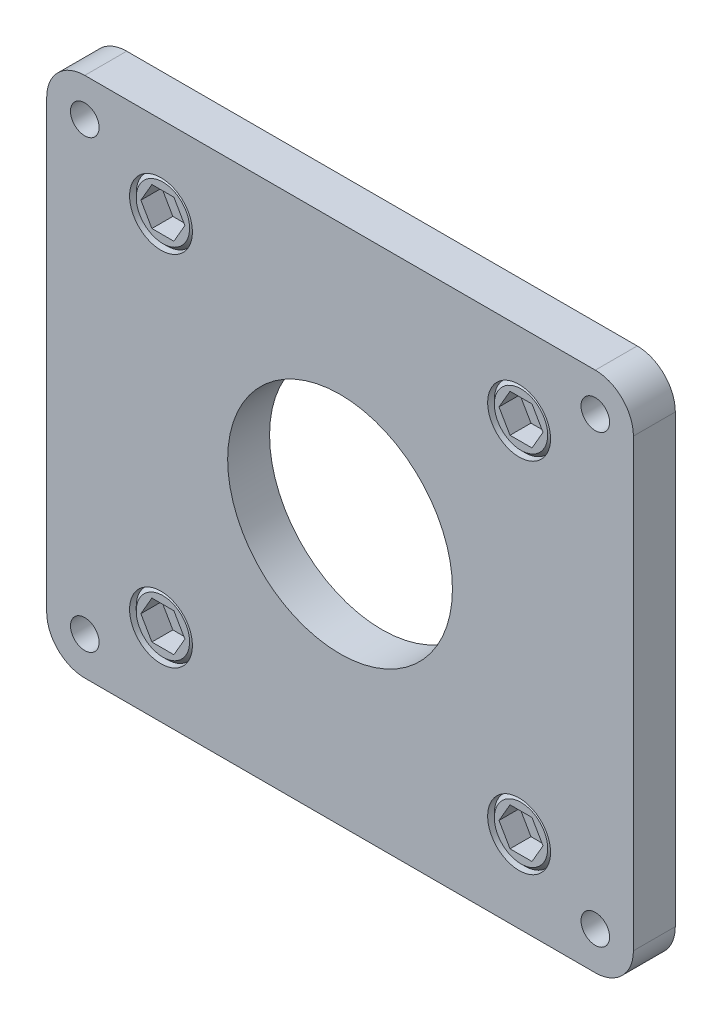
ISO-10303-21;
HEADER;
FILE_DESCRIPTION(('STEP AP214'),'2;1');
FILE_NAME('part.step','',(''),(''),'','','');
FILE_SCHEMA(('AUTOMOTIVE_DESIGN { 1 0 10303 214 1 1 1 1 }'));
ENDSEC;
DATA;
#1=APPLICATION_CONTEXT('core data for automotive mechanical design processes');
#2=APPLICATION_PROTOCOL_DEFINITION('international standard','automotive_design',2000,#1);
#3=PRODUCT_CONTEXT('',#1,'mechanical');
#4=PRODUCT('Part','Part','',(#3));
#5=PRODUCT_RELATED_PRODUCT_CATEGORY('part','',(#4));
#6=PRODUCT_DEFINITION_FORMATION('','',#4);
#7=PRODUCT_DEFINITION_CONTEXT('part definition',#1,'design');
#8=PRODUCT_DEFINITION('design','',#6,#7);
#9=PRODUCT_DEFINITION_SHAPE('','',#8);
#10=(LENGTH_UNIT() NAMED_UNIT(*) SI_UNIT(.MILLI.,.METRE.));
#11=(NAMED_UNIT(*) PLANE_ANGLE_UNIT() SI_UNIT($,.RADIAN.));
#12=(NAMED_UNIT(*) SI_UNIT($,.STERADIAN.) SOLID_ANGLE_UNIT());
#13=UNCERTAINTY_MEASURE_WITH_UNIT(LENGTH_MEASURE(1.E-05),#10,'distance_accuracy_value','');
#14=(GEOMETRIC_REPRESENTATION_CONTEXT(3) GLOBAL_UNCERTAINTY_ASSIGNED_CONTEXT((#13)) GLOBAL_UNIT_ASSIGNED_CONTEXT((#10,
#11,#12)) REPRESENTATION_CONTEXT('',''));
#15=CARTESIAN_POINT('',(0.,0.,0.));
#16=DIRECTION('',(0.,0.,1.));
#17=DIRECTION('',(1.,0.,0.));
#18=AXIS2_PLACEMENT_3D('',#15,#16,#17);
#19=CARTESIAN_POINT('',(-47.,-47.,4.49999999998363));
#20=DIRECTION('',(0.,0.,-1.));
#21=DIRECTION('',(-1.,0.,0.));
#22=AXIS2_PLACEMENT_3D('',#19,#20,#21);
#23=PLANE('',#22);
#24=CARTESIAN_POINT('',(-47.,-47.,4.49999999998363));
#25=DIRECTION('',(0.,0.,1.));
#26=DIRECTION('',(-1.,0.,0.));
#27=AXIS2_PLACEMENT_3D('',#24,#25,#26);
#28=CIRCLE('',#27,8.25);
#29=CARTESIAN_POINT('',(-38.75,-47.,4.49999999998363));
#30=VERTEX_POINT('',#29);
#31=EDGE_CURVE('E458',#30,#30,#28,.T.);
#32=ORIENTED_EDGE('',*,*,#31,.T.);
#33=EDGE_LOOP('',(#32));
#34=FACE_BOUND('',#33,.T.);
#35=CARTESIAN_POINT('',(-47.,-47.,4.49999999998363));
#36=DIRECTION('',(0.,0.,-1.));
#37=DIRECTION('',(-1.,0.,0.));
#38=AXIS2_PLACEMENT_3D('',#35,#36,#37);
#39=CIRCLE('',#38,8.);
#40=CARTESIAN_POINT('',(-55.,-47.,4.49999999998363));
#41=VERTEX_POINT('',#40);
#42=EDGE_CURVE('E511',#41,#41,#39,.F.);
#43=ORIENTED_EDGE('',*,*,#42,.F.);
#44=EDGE_LOOP('',(#43));
#45=FACE_BOUND('',#44,.T.);
#46=ADVANCED_FACE('F34',(#34,#45),#23,.F.);
#47=CARTESIAN_POINT('',(47.,-47.,4.49999999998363));
#48=DIRECTION('',(0.,0.,1.));
#49=DIRECTION('',(1.,0.,0.));
#50=AXIS2_PLACEMENT_3D('',#47,#48,#49);
#51=PLANE('',#50);
#52=CARTESIAN_POINT('',(47.,-47.,4.49999999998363));
#53=DIRECTION('',(0.,0.,1.));
#54=DIRECTION('',(1.,0.,0.));
#55=AXIS2_PLACEMENT_3D('',#52,#53,#54);
#56=CIRCLE('',#55,8.25);
#57=CARTESIAN_POINT('',(55.25,-47.,4.49999999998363));
#58=VERTEX_POINT('',#57);
#59=EDGE_CURVE('E464',#58,#58,#56,.T.);
#60=ORIENTED_EDGE('',*,*,#59,.T.);
#61=EDGE_LOOP('',(#60));
#62=FACE_BOUND('',#61,.T.);
#63=CARTESIAN_POINT('',(47.,-47.,4.49999999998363));
#64=DIRECTION('',(0.,0.,1.));
#65=DIRECTION('',(1.,0.,0.));
#66=AXIS2_PLACEMENT_3D('',#63,#64,#65);
#67=CIRCLE('',#66,8.);
#68=CARTESIAN_POINT('',(55.,-47.,4.49999999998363));
#69=VERTEX_POINT('',#68);
#70=EDGE_CURVE('E441',#69,#69,#67,.T.);
#71=ORIENTED_EDGE('',*,*,#70,.F.);
#72=EDGE_LOOP('',(#71));
#73=FACE_BOUND('',#72,.T.);
#74=ADVANCED_FACE('F610',(#62,#73),#51,.T.);
#75=CARTESIAN_POINT('',(47.,47.,4.49999999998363));
#76=DIRECTION('',(0.,0.,-1.));
#77=DIRECTION('',(-1.,0.,0.));
#78=AXIS2_PLACEMENT_3D('',#75,#76,#77);
#79=PLANE('',#78);
#80=CARTESIAN_POINT('',(47.,47.,4.49999999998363));
#81=DIRECTION('',(0.,0.,1.));
#82=DIRECTION('',(-1.,0.,0.));
#83=AXIS2_PLACEMENT_3D('',#80,#81,#82);
#84=CIRCLE('',#83,8.25);
#85=CARTESIAN_POINT('',(55.25,47.,4.49999999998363));
#86=VERTEX_POINT('',#85);
#87=EDGE_CURVE('E470',#86,#86,#84,.T.);
#88=ORIENTED_EDGE('',*,*,#87,.T.);
#89=EDGE_LOOP('',(#88));
#90=FACE_BOUND('',#89,.T.);
#91=CARTESIAN_POINT('',(47.,47.,4.49999999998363));
#92=DIRECTION('',(0.,0.,-1.));
#93=DIRECTION('',(-1.,0.,0.));
#94=AXIS2_PLACEMENT_3D('',#91,#92,#93);
#95=CIRCLE('',#94,8.);
#96=CARTESIAN_POINT('',(39.,47.,4.49999999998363));
#97=VERTEX_POINT('',#96);
#98=EDGE_CURVE('E499',#97,#97,#95,.F.);
#99=ORIENTED_EDGE('',*,*,#98,.F.);
#100=EDGE_LOOP('',(#99));
#101=FACE_BOUND('',#100,.T.);
#102=ADVANCED_FACE('F616',(#90,#101),#79,.F.);
#103=CARTESIAN_POINT('',(-47.,47.,4.49999999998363));
#104=DIRECTION('',(0.,0.,1.));
#105=DIRECTION('',(1.,0.,0.));
#106=AXIS2_PLACEMENT_3D('',#103,#104,#105);
#107=PLANE('',#106);
#108=CARTESIAN_POINT('',(-47.,47.,4.49999999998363));
#109=DIRECTION('',(0.,0.,1.));
#110=DIRECTION('',(1.,0.,0.));
#111=AXIS2_PLACEMENT_3D('',#108,#109,#110);
#112=CIRCLE('',#111,8.25);
#113=CARTESIAN_POINT('',(-38.75,47.,4.49999999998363));
#114=VERTEX_POINT('',#113);
#115=EDGE_CURVE('E476',#114,#114,#112,.T.);
#116=ORIENTED_EDGE('',*,*,#115,.T.);
#117=EDGE_LOOP('',(#116));
#118=FACE_BOUND('',#117,.T.);
#119=CARTESIAN_POINT('',(-47.,47.,4.49999999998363));
#120=DIRECTION('',(0.,0.,1.));
#121=DIRECTION('',(1.,0.,0.));
#122=AXIS2_PLACEMENT_3D('',#119,#120,#121);
#123=CIRCLE('',#122,8.);
#124=CARTESIAN_POINT('',(-39.,47.,4.49999999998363));
#125=VERTEX_POINT('',#124);
#126=EDGE_CURVE('E454',#125,#125,#123,.T.);
#127=ORIENTED_EDGE('',*,*,#126,.F.);
#128=EDGE_LOOP('',(#127));
#129=FACE_BOUND('',#128,.T.);
#130=ADVANCED_FACE('F635',(#118,#129),#107,.T.);
#131=CARTESIAN_POINT('',(-77.,-68.5,11.));
#132=DIRECTION('',(0.,0.,1.));
#133=DIRECTION('',(1.,0.,0.));
#134=AXIS2_PLACEMENT_3D('',#131,#132,#133);
#135=PLANE('',#134);
#136=CARTESIAN_POINT('',(-67.,58.5,11.));
#137=DIRECTION('',(0.,0.,1.));
#138=DIRECTION('',(1.,0.,0.));
#139=AXIS2_PLACEMENT_3D('',#136,#137,#138);
#140=CIRCLE('',#139,3.75000000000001);
#141=CARTESIAN_POINT('',(-63.25,58.5,11.));
#142=VERTEX_POINT('',#141);
#143=EDGE_CURVE('E1281',#142,#142,#140,.T.);
#144=ORIENTED_EDGE('',*,*,#143,.F.);
#145=EDGE_LOOP('',(#144));
#146=FACE_BOUND('',#145,.T.);
#147=CARTESIAN_POINT('',(-67.,-58.5,11.));
#148=DIRECTION('',(0.,0.,1.));
#149=DIRECTION('',(-1.,0.,0.));
#150=AXIS2_PLACEMENT_3D('',#147,#148,#149);
#151=CIRCLE('',#150,3.75000000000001);
#152=CARTESIAN_POINT('',(-70.75,-58.5,11.));
#153=VERTEX_POINT('',#152);
#154=EDGE_CURVE('E1283',#153,#153,#151,.T.);
#155=ORIENTED_EDGE('',*,*,#154,.F.);
#156=EDGE_LOOP('',(#155));
#157=FACE_BOUND('',#156,.T.);
#158=CARTESIAN_POINT('',(67.,58.5,11.));
#159=DIRECTION('',(0.,0.,1.));
#160=DIRECTION('',(-1.,0.,0.));
#161=AXIS2_PLACEMENT_3D('',#158,#159,#160);
#162=CIRCLE('',#161,3.75000000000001);
#163=CARTESIAN_POINT('',(63.25,58.5,11.));
#164=VERTEX_POINT('',#163);
#165=EDGE_CURVE('E1289',#164,#164,#162,.T.);
#166=ORIENTED_EDGE('',*,*,#165,.F.);
#167=EDGE_LOOP('',(#166));
#168=FACE_BOUND('',#167,.T.);
#169=CARTESIAN_POINT('',(67.,-58.5,11.));
#170=DIRECTION('',(0.,0.,1.));
#171=DIRECTION('',(1.,0.,0.));
#172=AXIS2_PLACEMENT_3D('',#169,#170,#171);
#173=CIRCLE('',#172,3.75000000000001);
#174=CARTESIAN_POINT('',(70.75,-58.5,11.));
#175=VERTEX_POINT('',#174);
#176=EDGE_CURVE('E276',#175,#175,#173,.T.);
#177=ORIENTED_EDGE('',*,*,#176,.F.);
#178=EDGE_LOOP('',(#177));
#179=FACE_BOUND('',#178,.T.);
#180=CARTESIAN_POINT('',(-47.,-47.,10.9999999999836));
#181=DIRECTION('',(0.,0.,1.));
#182=DIRECTION('',(-1.,0.,0.));
#183=AXIS2_PLACEMENT_3D('',#180,#181,#182);
#184=CIRCLE('',#183,8.25);
#185=CARTESIAN_POINT('',(-38.75,-47.,10.9999999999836));
#186=VERTEX_POINT('',#185);
#187=EDGE_CURVE('E457',#186,#186,#184,.T.);
#188=ORIENTED_EDGE('',*,*,#187,.F.);
#189=EDGE_LOOP('',(#188));
#190=FACE_BOUND('',#189,.T.);
#191=CARTESIAN_POINT('',(47.,-47.,10.9999999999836));
#192=DIRECTION('',(0.,0.,1.));
#193=DIRECTION('',(1.,0.,0.));
#194=AXIS2_PLACEMENT_3D('',#191,#192,#193);
#195=CIRCLE('',#194,8.25);
#196=CARTESIAN_POINT('',(55.25,-47.,10.9999999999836));
#197=VERTEX_POINT('',#196);
#198=EDGE_CURVE('E461',#197,#197,#195,.T.);
#199=ORIENTED_EDGE('',*,*,#198,.F.);
#200=EDGE_LOOP('',(#199));
#201=FACE_BOUND('',#200,.T.);
#202=CARTESIAN_POINT('',(47.,47.,10.9999999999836));
#203=DIRECTION('',(0.,0.,1.));
#204=DIRECTION('',(-1.,0.,0.));
#205=AXIS2_PLACEMENT_3D('',#202,#203,#204);
#206=CIRCLE('',#205,8.25);
#207=CARTESIAN_POINT('',(55.25,47.,10.9999999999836));
#208=VERTEX_POINT('',#207);
#209=EDGE_CURVE('E467',#208,#208,#206,.T.);
#210=ORIENTED_EDGE('',*,*,#209,.F.);
#211=EDGE_LOOP('',(#210));
#212=FACE_BOUND('',#211,.T.);
#213=CARTESIAN_POINT('',(-47.,47.,10.9999999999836));
#214=DIRECTION('',(0.,0.,1.));
#215=DIRECTION('',(1.,0.,0.));
#216=AXIS2_PLACEMENT_3D('',#213,#214,#215);
#217=CIRCLE('',#216,8.25);
#218=CARTESIAN_POINT('',(-38.75,47.,10.9999999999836));
#219=VERTEX_POINT('',#218);
#220=EDGE_CURVE('E473',#219,#219,#217,.T.);
#221=ORIENTED_EDGE('',*,*,#220,.F.);
#222=EDGE_LOOP('',(#221));
#223=FACE_BOUND('',#222,.T.);
#224=DIRECTION('',(1.,0.,0.));
#225=VECTOR('',#224,1.);
#226=CARTESIAN_POINT('',(-77.,-68.5,11.));
#227=LINE('',#226,#225);
#228=CARTESIAN_POINT('',(-67.,-68.5,11.));
#229=VERTEX_POINT('',#228);
#230=CARTESIAN_POINT('',(67.,-68.5,11.));
#231=VERTEX_POINT('',#230);
#232=EDGE_CURVE('E491',#229,#231,#227,.T.);
#233=ORIENTED_EDGE('',*,*,#232,.T.);
#234=CARTESIAN_POINT('',(67.,-58.5,11.));
#235=DIRECTION('',(0.,0.,1.));
#236=DIRECTION('',(1.,0.,0.));
#237=AXIS2_PLACEMENT_3D('',#234,#235,#236);
#238=CIRCLE('',#237,10.);
#239=CARTESIAN_POINT('',(77.,-58.5,11.));
#240=VERTEX_POINT('',#239);
#241=EDGE_CURVE('E561',#231,#240,#238,.T.);
#242=ORIENTED_EDGE('',*,*,#241,.T.);
#243=DIRECTION('',(0.,1.,0.));
#244=VECTOR('',#243,1.);
#245=CARTESIAN_POINT('',(77.,68.5,11.));
#246=LINE('',#245,#244);
#247=CARTESIAN_POINT('',(77.,58.5,11.));
#248=VERTEX_POINT('',#247);
#249=EDGE_CURVE('E495',#240,#248,#246,.T.);
#250=ORIENTED_EDGE('',*,*,#249,.T.);
#251=CARTESIAN_POINT('',(67.,58.5,11.));
#252=DIRECTION('',(0.,0.,1.));
#253=DIRECTION('',(1.,0.,0.));
#254=AXIS2_PLACEMENT_3D('',#251,#252,#253);
#255=CIRCLE('',#254,10.);
#256=CARTESIAN_POINT('',(67.,68.5,11.));
#257=VERTEX_POINT('',#256);
#258=EDGE_CURVE('E56',#248,#257,#255,.T.);
#259=ORIENTED_EDGE('',*,*,#258,.T.);
#260=DIRECTION('',(-1.,0.,0.));
#261=VECTOR('',#260,1.);
#262=CARTESIAN_POINT('',(-77.,68.5,11.));
#263=LINE('',#262,#261);
#264=CARTESIAN_POINT('',(-67.,68.5,11.));
#265=VERTEX_POINT('',#264);
#266=EDGE_CURVE('E497',#257,#265,#263,.T.);
#267=ORIENTED_EDGE('',*,*,#266,.T.);
#268=CARTESIAN_POINT('',(-67.,58.5,11.));
#269=DIRECTION('',(0.,0.,1.));
#270=DIRECTION('',(1.,0.,0.));
#271=AXIS2_PLACEMENT_3D('',#268,#269,#270);
#272=CIRCLE('',#271,10.);
#273=CARTESIAN_POINT('',(-77.,58.5,11.));
#274=VERTEX_POINT('',#273);
#275=EDGE_CURVE('E558',#265,#274,#272,.T.);
#276=ORIENTED_EDGE('',*,*,#275,.T.);
#277=DIRECTION('',(0.,-1.,0.));
#278=VECTOR('',#277,1.);
#279=CARTESIAN_POINT('',(-77.,68.5,11.));
#280=LINE('',#279,#278);
#281=CARTESIAN_POINT('',(-77.,-58.5,11.));
#282=VERTEX_POINT('',#281);
#283=EDGE_CURVE('E488',#274,#282,#280,.T.);
#284=ORIENTED_EDGE('',*,*,#283,.T.);
#285=CARTESIAN_POINT('',(-67.,-58.5,11.));
#286=DIRECTION('',(0.,0.,1.));
#287=DIRECTION('',(1.,0.,0.));
#288=AXIS2_PLACEMENT_3D('',#285,#286,#287);
#289=CIRCLE('',#288,10.);
#290=EDGE_CURVE('E556',#282,#229,#289,.T.);
#291=ORIENTED_EDGE('',*,*,#290,.T.);
#292=EDGE_LOOP('',(#233,#242,#250,#259,#267,#276,#284,#291));
#293=FACE_BOUND('',#292,.T.);
#294=CARTESIAN_POINT('',(0.,0.,11.));
#295=DIRECTION('',(0.,0.,1.));
#296=DIRECTION('',(1.,0.,0.));
#297=AXIS2_PLACEMENT_3D('',#294,#295,#296);
#298=CIRCLE('',#297,29.5);
#299=CARTESIAN_POINT('',(29.5,0.,11.));
#300=VERTEX_POINT('',#299);
#301=EDGE_CURVE('E482',#300,#300,#298,.T.);
#302=ORIENTED_EDGE('',*,*,#301,.F.);
#303=EDGE_LOOP('',(#302));
#304=FACE_BOUND('',#303,.T.);
#305=ADVANCED_FACE('F574',(#146,#157,#168,#179,#190,#201,#212,#223,#293,#304),#135,.T.);
#306=CARTESIAN_POINT('',(-77.,-68.5,0.));
#307=DIRECTION('',(0.,0.,1.));
#308=DIRECTION('',(1.,0.,0.));
#309=AXIS2_PLACEMENT_3D('',#306,#307,#308);
#310=PLANE('',#309);
#311=CARTESIAN_POINT('',(-67.,58.5,0.));
#312=DIRECTION('',(0.,0.,1.));
#313=DIRECTION('',(1.,0.,0.));
#314=AXIS2_PLACEMENT_3D('',#311,#312,#313);
#315=CIRCLE('',#314,3.75000000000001);
#316=CARTESIAN_POINT('',(-63.25,58.5,0.));
#317=VERTEX_POINT('',#316);
#318=EDGE_CURVE('E1278',#317,#317,#315,.T.);
#319=ORIENTED_EDGE('',*,*,#318,.T.);
#320=EDGE_LOOP('',(#319));
#321=FACE_BOUND('',#320,.T.);
#322=CARTESIAN_POINT('',(-67.,-58.5,0.));
#323=DIRECTION('',(0.,0.,1.));
#324=DIRECTION('',(-1.,0.,0.));
#325=AXIS2_PLACEMENT_3D('',#322,#323,#324);
#326=CIRCLE('',#325,3.75000000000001);
#327=CARTESIAN_POINT('',(-70.75,-58.5,0.));
#328=VERTEX_POINT('',#327);
#329=EDGE_CURVE('E1286',#328,#328,#326,.T.);
#330=ORIENTED_EDGE('',*,*,#329,.T.);
#331=EDGE_LOOP('',(#330));
#332=FACE_BOUND('',#331,.T.);
#333=CARTESIAN_POINT('',(67.,58.5,0.));
#334=DIRECTION('',(0.,0.,1.));
#335=DIRECTION('',(-1.,0.,0.));
#336=AXIS2_PLACEMENT_3D('',#333,#334,#335);
#337=CIRCLE('',#336,3.75000000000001);
#338=CARTESIAN_POINT('',(63.25,58.5,0.));
#339=VERTEX_POINT('',#338);
#340=EDGE_CURVE('E1292',#339,#339,#337,.T.);
#341=ORIENTED_EDGE('',*,*,#340,.T.);
#342=EDGE_LOOP('',(#341));
#343=FACE_BOUND('',#342,.T.);
#344=CARTESIAN_POINT('',(67.,-58.5,0.));
#345=DIRECTION('',(0.,0.,1.));
#346=DIRECTION('',(1.,0.,0.));
#347=AXIS2_PLACEMENT_3D('',#344,#345,#346);
#348=CIRCLE('',#347,3.75000000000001);
#349=CARTESIAN_POINT('',(70.75,-58.5,0.));
#350=VERTEX_POINT('',#349);
#351=EDGE_CURVE('E288',#350,#350,#348,.T.);
#352=ORIENTED_EDGE('',*,*,#351,.T.);
#353=EDGE_LOOP('',(#352));
#354=FACE_BOUND('',#353,.T.);
#355=DIRECTION('',(0.,1.,0.));
#356=VECTOR('',#355,1.);
#357=CARTESIAN_POINT('',(77.,68.5,0.));
#358=LINE('',#357,#356);
#359=CARTESIAN_POINT('',(77.,-58.5,0.));
#360=VERTEX_POINT('',#359);
#361=CARTESIAN_POINT('',(77.,58.5,0.));
#362=VERTEX_POINT('',#361);
#363=EDGE_CURVE('E505',#360,#362,#358,.T.);
#364=ORIENTED_EDGE('',*,*,#363,.F.);
#365=CARTESIAN_POINT('',(67.,-58.5,0.));
#366=DIRECTION('',(0.,0.,1.));
#367=DIRECTION('',(1.,0.,0.));
#368=AXIS2_PLACEMENT_3D('',#365,#366,#367);
#369=CIRCLE('',#368,10.);
#370=CARTESIAN_POINT('',(67.,-68.5,0.));
#371=VERTEX_POINT('',#370);
#372=EDGE_CURVE('E549',#360,#371,#369,.F.);
#373=ORIENTED_EDGE('',*,*,#372,.T.);
#374=DIRECTION('',(1.,0.,0.));
#375=VECTOR('',#374,1.);
#376=CARTESIAN_POINT('',(-77.,-68.5,0.));
#377=LINE('',#376,#375);
#378=CARTESIAN_POINT('',(-67.,-68.5,0.));
#379=VERTEX_POINT('',#378);
#380=EDGE_CURVE('E502',#379,#371,#377,.T.);
#381=ORIENTED_EDGE('',*,*,#380,.F.);
#382=CARTESIAN_POINT('',(-67.,-58.5,0.));
#383=DIRECTION('',(0.,0.,1.));
#384=DIRECTION('',(1.,0.,0.));
#385=AXIS2_PLACEMENT_3D('',#382,#383,#384);
#386=CIRCLE('',#385,10.);
#387=CARTESIAN_POINT('',(-77.,-58.5,0.));
#388=VERTEX_POINT('',#387);
#389=EDGE_CURVE('E543',#379,#388,#386,.F.);
#390=ORIENTED_EDGE('',*,*,#389,.T.);
#391=DIRECTION('',(0.,-1.,0.));
#392=VECTOR('',#391,1.);
#393=CARTESIAN_POINT('',(-77.,68.5,0.));
#394=LINE('',#393,#392);
#395=CARTESIAN_POINT('',(-77.,58.5,0.));
#396=VERTEX_POINT('',#395);
#397=EDGE_CURVE('E485',#396,#388,#394,.T.);
#398=ORIENTED_EDGE('',*,*,#397,.F.);
#399=CARTESIAN_POINT('',(-67.,58.5,0.));
#400=DIRECTION('',(0.,0.,1.));
#401=DIRECTION('',(1.,0.,0.));
#402=AXIS2_PLACEMENT_3D('',#399,#400,#401);
#403=CIRCLE('',#402,10.);
#404=CARTESIAN_POINT('',(-67.,68.5,0.));
#405=VERTEX_POINT('',#404);
#406=EDGE_CURVE('E545',#396,#405,#403,.F.);
#407=ORIENTED_EDGE('',*,*,#406,.T.);
#408=DIRECTION('',(-1.,0.,0.));
#409=VECTOR('',#408,1.);
#410=CARTESIAN_POINT('',(-77.,68.5,0.));
#411=LINE('',#410,#409);
#412=CARTESIAN_POINT('',(67.,68.5,0.));
#413=VERTEX_POINT('',#412);
#414=EDGE_CURVE('E492',#413,#405,#411,.T.);
#415=ORIENTED_EDGE('',*,*,#414,.F.);
#416=CARTESIAN_POINT('',(67.,58.5,0.));
#417=DIRECTION('',(0.,0.,1.));
#418=DIRECTION('',(1.,0.,0.));
#419=AXIS2_PLACEMENT_3D('',#416,#417,#418);
#420=CIRCLE('',#419,10.);
#421=EDGE_CURVE('E547',#413,#362,#420,.F.);
#422=ORIENTED_EDGE('',*,*,#421,.T.);
#423=EDGE_LOOP('',(#364,#373,#381,#390,#398,#407,#415,#422));
#424=FACE_BOUND('',#423,.T.);
#425=CARTESIAN_POINT('',(0.,0.,0.));
#426=DIRECTION('',(0.,0.,1.));
#427=DIRECTION('',(1.,0.,0.));
#428=AXIS2_PLACEMENT_3D('',#425,#426,#427);
#429=CIRCLE('',#428,29.5);
#430=CARTESIAN_POINT('',(29.5,0.,0.));
#431=VERTEX_POINT('',#430);
#432=EDGE_CURVE('E479',#431,#431,#429,.T.);
#433=ORIENTED_EDGE('',*,*,#432,.T.);
#434=EDGE_LOOP('',(#433));
#435=FACE_BOUND('',#434,.T.);
#436=ADVANCED_FACE('F585',(#321,#332,#343,#354,#424,#435),#310,.F.);
#437=CARTESIAN_POINT('',(-77.,68.5,11.));
#438=DIRECTION('',(1.,0.,0.));
#439=DIRECTION('',(0.,0.,-1.));
#440=AXIS2_PLACEMENT_3D('',#437,#438,#439);
#441=PLANE('',#440);
#442=ORIENTED_EDGE('',*,*,#283,.F.);
#443=DIRECTION('',(0.,0.,-1.));
#444=VECTOR('',#443,1.);
#445=CARTESIAN_POINT('',(-77.,58.5,11.));
#446=LINE('',#445,#444);
#447=EDGE_CURVE('E11',#274,#396,#446,.T.);
#448=ORIENTED_EDGE('',*,*,#447,.T.);
#449=ORIENTED_EDGE('',*,*,#397,.T.);
#450=DIRECTION('',(0.,0.,-1.));
#451=VECTOR('',#450,1.);
#452=CARTESIAN_POINT('',(-77.,-58.5,11.));
#453=LINE('',#452,#451);
#454=EDGE_CURVE('E42',#388,#282,#453,.F.);
#455=ORIENTED_EDGE('',*,*,#454,.T.);
#456=EDGE_LOOP('',(#442,#448,#449,#455));
#457=FACE_BOUND('',#456,.T.);
#458=ADVANCED_FACE('F569',(#457),#441,.F.);
#459=CARTESIAN_POINT('',(-77.,-68.5,11.));
#460=DIRECTION('',(0.,1.,0.));
#461=DIRECTION('',(0.,0.,1.));
#462=AXIS2_PLACEMENT_3D('',#459,#460,#461);
#463=PLANE('',#462);
#464=ORIENTED_EDGE('',*,*,#380,.T.);
#465=DIRECTION('',(0.,0.,-1.));
#466=VECTOR('',#465,1.);
#467=CARTESIAN_POINT('',(67.,-68.5,11.));
#468=LINE('',#467,#466);
#469=EDGE_CURVE('E554',#371,#231,#468,.F.);
#470=ORIENTED_EDGE('',*,*,#469,.T.);
#471=ORIENTED_EDGE('',*,*,#232,.F.);
#472=DIRECTION('',(0.,0.,-1.));
#473=VECTOR('',#472,1.);
#474=CARTESIAN_POINT('',(-67.,-68.5,11.));
#475=LINE('',#474,#473);
#476=EDGE_CURVE('E551',#229,#379,#475,.T.);
#477=ORIENTED_EDGE('',*,*,#476,.T.);
#478=EDGE_LOOP('',(#464,#470,#471,#477));
#479=FACE_BOUND('',#478,.T.);
#480=ADVANCED_FACE('F581',(#479),#463,.F.);
#481=CARTESIAN_POINT('',(77.,68.5,11.));
#482=DIRECTION('',(-1.,0.,0.));
#483=DIRECTION('',(0.,0.,1.));
#484=AXIS2_PLACEMENT_3D('',#481,#482,#483);
#485=PLANE('',#484);
#486=ORIENTED_EDGE('',*,*,#249,.F.);
#487=DIRECTION('',(0.,0.,-1.));
#488=VECTOR('',#487,1.);
#489=CARTESIAN_POINT('',(77.,-58.5,11.));
#490=LINE('',#489,#488);
#491=EDGE_CURVE('E540',#240,#360,#490,.T.);
#492=ORIENTED_EDGE('',*,*,#491,.T.);
#493=ORIENTED_EDGE('',*,*,#363,.T.);
#494=DIRECTION('',(0.,0.,-1.));
#495=VECTOR('',#494,1.);
#496=CARTESIAN_POINT('',(77.,58.5,11.));
#497=LINE('',#496,#495);
#498=EDGE_CURVE('E538',#362,#248,#497,.F.);
#499=ORIENTED_EDGE('',*,*,#498,.T.);
#500=EDGE_LOOP('',(#486,#492,#493,#499));
#501=FACE_BOUND('',#500,.T.);
#502=ADVANCED_FACE('F593',(#501),#485,.F.);
#503=CARTESIAN_POINT('',(-77.,68.5,11.));
#504=DIRECTION('',(0.,-1.,0.));
#505=DIRECTION('',(0.,0.,-1.));
#506=AXIS2_PLACEMENT_3D('',#503,#504,#505);
#507=PLANE('',#506);
#508=ORIENTED_EDGE('',*,*,#266,.F.);
#509=DIRECTION('',(0.,0.,-1.));
#510=VECTOR('',#509,1.);
#511=CARTESIAN_POINT('',(67.,68.5,11.));
#512=LINE('',#511,#510);
#513=EDGE_CURVE('E564',#257,#413,#512,.T.);
#514=ORIENTED_EDGE('',*,*,#513,.T.);
#515=ORIENTED_EDGE('',*,*,#414,.T.);
#516=DIRECTION('',(0.,0.,-1.));
#517=VECTOR('',#516,1.);
#518=CARTESIAN_POINT('',(-67.,68.5,11.));
#519=LINE('',#518,#517);
#520=EDGE_CURVE('E49',#405,#265,#519,.F.);
#521=ORIENTED_EDGE('',*,*,#520,.T.);
#522=EDGE_LOOP('',(#508,#514,#515,#521));
#523=FACE_BOUND('',#522,.T.);
#524=ADVANCED_FACE('F599',(#523),#507,.F.);
#525=CARTESIAN_POINT('',(0.,0.,11.));
#526=DIRECTION('',(0.,0.,-1.));
#527=DIRECTION('',(-1.,0.,0.));
#528=AXIS2_PLACEMENT_3D('',#525,#526,#527);
#529=CYLINDRICAL_SURFACE('',#528,29.5);
#530=ORIENTED_EDGE('',*,*,#301,.T.);
#531=EDGE_LOOP('',(#530));
#532=FACE_BOUND('',#531,.T.);
#533=ORIENTED_EDGE('',*,*,#432,.F.);
#534=EDGE_LOOP('',(#533));
#535=FACE_BOUND('',#534,.T.);
#536=ADVANCED_FACE('F646',(#532,#535),#529,.F.);
#537=CARTESIAN_POINT('',(-47.,47.,4.49999999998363));
#538=DIRECTION('',(0.,0.,1.));
#539=DIRECTION('',(1.,0.,0.));
#540=AXIS2_PLACEMENT_3D('',#537,#538,#539);
#541=CYLINDRICAL_SURFACE('',#540,8.25);
#542=CARTESIAN_POINT('',(-38.75,47.,4.49999999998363));
#543=CARTESIAN_POINT('',(-38.75,47.,4.56770833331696));
#544=CARTESIAN_POINT('',(-38.75,47.,4.6354166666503));
#545=CARTESIAN_POINT('',(-38.75,47.,4.77083333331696));
#546=CARTESIAN_POINT('',(-38.75,47.,4.8385416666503));
#547=CARTESIAN_POINT('',(-38.75,47.,4.97395833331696));
#548=CARTESIAN_POINT('',(-38.75,47.,5.0416666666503));
#549=CARTESIAN_POINT('',(-38.75,47.,5.17708333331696));
#550=CARTESIAN_POINT('',(-38.75,47.,5.2447916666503));
#551=CARTESIAN_POINT('',(-38.75,47.,5.38020833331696));
#552=CARTESIAN_POINT('',(-38.75,47.,5.4479166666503));
#553=CARTESIAN_POINT('',(-38.75,47.,5.58333333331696));
#554=CARTESIAN_POINT('',(-38.75,47.,5.6510416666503));
#555=CARTESIAN_POINT('',(-38.75,47.,5.78645833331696));
#556=CARTESIAN_POINT('',(-38.75,47.,5.8541666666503));
#557=CARTESIAN_POINT('',(-38.75,47.,5.98958333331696));
#558=CARTESIAN_POINT('',(-38.75,47.,6.0572916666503));
#559=CARTESIAN_POINT('',(-38.75,47.,6.19270833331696));
#560=CARTESIAN_POINT('',(-38.75,47.,6.2604166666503));
#561=CARTESIAN_POINT('',(-38.75,47.,6.39583333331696));
#562=CARTESIAN_POINT('',(-38.75,47.,6.46354166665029));
#563=CARTESIAN_POINT('',(-38.75,47.,6.59895833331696));
#564=CARTESIAN_POINT('',(-38.75,47.,6.6666666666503));
#565=CARTESIAN_POINT('',(-38.75,47.,6.80208333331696));
#566=CARTESIAN_POINT('',(-38.75,47.,6.8697916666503));
#567=CARTESIAN_POINT('',(-38.75,47.,7.00520833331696));
#568=CARTESIAN_POINT('',(-38.75,47.,7.0729166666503));
#569=CARTESIAN_POINT('',(-38.75,47.,7.20833333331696));
#570=CARTESIAN_POINT('',(-38.75,47.,7.2760416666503));
#571=CARTESIAN_POINT('',(-38.75,47.,7.41145833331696));
#572=CARTESIAN_POINT('',(-38.75,47.,7.4791666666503));
#573=CARTESIAN_POINT('',(-38.75,47.,7.61458333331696));
#574=CARTESIAN_POINT('',(-38.75,47.,7.6822916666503));
#575=CARTESIAN_POINT('',(-38.75,47.,7.81770833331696));
#576=CARTESIAN_POINT('',(-38.75,47.,7.8854166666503));
#577=CARTESIAN_POINT('',(-38.75,47.,8.02083333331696));
#578=CARTESIAN_POINT('',(-38.75,47.,8.0885416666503));
#579=CARTESIAN_POINT('',(-38.75,47.,8.22395833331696));
#580=CARTESIAN_POINT('',(-38.75,47.,8.2916666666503));
#581=CARTESIAN_POINT('',(-38.75,47.,8.42708333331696));
#582=CARTESIAN_POINT('',(-38.75,47.,8.4947916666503));
#583=CARTESIAN_POINT('',(-38.75,47.,8.63020833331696));
#584=CARTESIAN_POINT('',(-38.75,47.,8.6979166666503));
#585=CARTESIAN_POINT('',(-38.75,47.,8.83333333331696));
#586=CARTESIAN_POINT('',(-38.75,47.,8.9010416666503));
#587=CARTESIAN_POINT('',(-38.75,47.,9.03645833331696));
#588=CARTESIAN_POINT('',(-38.75,47.,9.1041666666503));
#589=CARTESIAN_POINT('',(-38.75,47.,9.23958333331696));
#590=CARTESIAN_POINT('',(-38.75,47.,9.3072916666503));
#591=CARTESIAN_POINT('',(-38.75,47.,9.44270833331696));
#592=CARTESIAN_POINT('',(-38.75,47.,9.5104166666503));
#593=CARTESIAN_POINT('',(-38.75,47.,9.64583333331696));
#594=CARTESIAN_POINT('',(-38.75,47.,9.7135416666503));
#595=CARTESIAN_POINT('',(-38.75,47.,9.84895833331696));
#596=CARTESIAN_POINT('',(-38.75,47.,9.9166666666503));
#597=CARTESIAN_POINT('',(-38.75,47.,10.052083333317));
#598=CARTESIAN_POINT('',(-38.75,47.,10.1197916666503));
#599=CARTESIAN_POINT('',(-38.75,47.,10.255208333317));
#600=CARTESIAN_POINT('',(-38.75,47.,10.3229166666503));
#601=CARTESIAN_POINT('',(-38.75,47.,10.458333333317));
#602=CARTESIAN_POINT('',(-38.75,47.,10.5260416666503));
#603=CARTESIAN_POINT('',(-38.75,47.,10.661458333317));
#604=CARTESIAN_POINT('',(-38.75,47.,10.7291666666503));
#605=CARTESIAN_POINT('',(-38.75,47.,10.864583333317));
#606=CARTESIAN_POINT('',(-38.75,47.,10.9322916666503));
#607=CARTESIAN_POINT('',(-38.75,47.,10.9999999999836));
#608=B_SPLINE_CURVE_WITH_KNOTS('',3,(#542,#543,#544,#545,#546,#547,#548,#549,#550,#551,#552,
#553,#554,#555,#556,#557,#558,#559,#560,#561,#562,#563,#564,#565,#566,#567,#568,#569,#570,#571,
#572,#573,#574,#575,#576,#577,#578,#579,#580,#581,#582,#583,#584,#585,#586,#587,#588,#589,#590,
#591,#592,#593,#594,#595,#596,#597,#598,#599,#600,#601,#602,#603,#604,#605,#606,#607),
.UNSPECIFIED.,.F.,.F.,(4,2,2,2,2,2,2,2,2,2,2,2,2,2,2,2,2,2,2,2,2,2,2,2,2,2,2,2,2,2,2,2,4),(0.,
0.203124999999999,0.40625,0.609375,0.8125,1.015625,1.21875,1.421875,1.625,1.828125,2.03125,
2.234375,2.4375,2.640625,2.84375,3.046875,3.25,3.453125,3.65625,3.859375,4.0625,4.265625,
4.46875,4.671875,4.875,5.078125,5.28125,5.484375,5.6875,5.890625,6.09375,6.296875,6.5),.UNSPECIFIED.);
#609=EDGE_CURVE('BSEAM639',#114,#219,#608,.T.);
#610=ORIENTED_EDGE('',*,*,#115,.F.);
#611=ORIENTED_EDGE('',*,*,#220,.T.);
#612=ORIENTED_EDGE('',*,*,#609,.T.);
#613=ORIENTED_EDGE('',*,*,#609,.F.);
#614=EDGE_LOOP('',(#610,#612,#611,#613));
#615=FACE_BOUND('',#614,.T.);
#616=ADVANCED_FACE('F639',(#615),#541,.F.);
#617=CARTESIAN_POINT('',(47.,47.,4.49999999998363));
#618=DIRECTION('',(0.,0.,1.));
#619=DIRECTION('',(1.,0.,0.));
#620=AXIS2_PLACEMENT_3D('',#617,#618,#619);
#621=CYLINDRICAL_SURFACE('',#620,8.25);
#622=CARTESIAN_POINT('',(55.25,47.,4.49999999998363));
#623=CARTESIAN_POINT('',(55.25,47.,4.56770833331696));
#624=CARTESIAN_POINT('',(55.25,47.,4.6354166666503));
#625=CARTESIAN_POINT('',(55.25,47.,4.77083333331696));
#626=CARTESIAN_POINT('',(55.25,47.,4.8385416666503));
#627=CARTESIAN_POINT('',(55.25,47.,4.97395833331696));
#628=CARTESIAN_POINT('',(55.25,47.,5.0416666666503));
#629=CARTESIAN_POINT('',(55.25,47.,5.17708333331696));
#630=CARTESIAN_POINT('',(55.25,47.,5.2447916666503));
#631=CARTESIAN_POINT('',(55.25,47.,5.38020833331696));
#632=CARTESIAN_POINT('',(55.25,47.,5.4479166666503));
#633=CARTESIAN_POINT('',(55.25,47.,5.58333333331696));
#634=CARTESIAN_POINT('',(55.25,47.,5.6510416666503));
#635=CARTESIAN_POINT('',(55.25,47.,5.78645833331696));
#636=CARTESIAN_POINT('',(55.25,47.,5.8541666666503));
#637=CARTESIAN_POINT('',(55.25,47.,5.98958333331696));
#638=CARTESIAN_POINT('',(55.25,47.,6.0572916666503));
#639=CARTESIAN_POINT('',(55.25,47.,6.19270833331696));
#640=CARTESIAN_POINT('',(55.25,47.,6.2604166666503));
#641=CARTESIAN_POINT('',(55.25,47.,6.39583333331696));
#642=CARTESIAN_POINT('',(55.25,47.,6.46354166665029));
#643=CARTESIAN_POINT('',(55.25,47.,6.59895833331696));
#644=CARTESIAN_POINT('',(55.25,47.,6.6666666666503));
#645=CARTESIAN_POINT('',(55.25,47.,6.80208333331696));
#646=CARTESIAN_POINT('',(55.25,47.,6.8697916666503));
#647=CARTESIAN_POINT('',(55.25,47.,7.00520833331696));
#648=CARTESIAN_POINT('',(55.25,47.,7.0729166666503));
#649=CARTESIAN_POINT('',(55.25,47.,7.20833333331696));
#650=CARTESIAN_POINT('',(55.25,47.,7.2760416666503));
#651=CARTESIAN_POINT('',(55.25,47.,7.41145833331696));
#652=CARTESIAN_POINT('',(55.25,47.,7.4791666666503));
#653=CARTESIAN_POINT('',(55.25,47.,7.61458333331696));
#654=CARTESIAN_POINT('',(55.25,47.,7.6822916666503));
#655=CARTESIAN_POINT('',(55.25,47.,7.81770833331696));
#656=CARTESIAN_POINT('',(55.25,47.,7.8854166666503));
#657=CARTESIAN_POINT('',(55.25,47.,8.02083333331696));
#658=CARTESIAN_POINT('',(55.25,47.,8.0885416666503));
#659=CARTESIAN_POINT('',(55.25,47.,8.22395833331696));
#660=CARTESIAN_POINT('',(55.25,47.,8.2916666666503));
#661=CARTESIAN_POINT('',(55.25,47.,8.42708333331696));
#662=CARTESIAN_POINT('',(55.25,47.,8.4947916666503));
#663=CARTESIAN_POINT('',(55.25,47.,8.63020833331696));
#664=CARTESIAN_POINT('',(55.25,47.,8.6979166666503));
#665=CARTESIAN_POINT('',(55.25,47.,8.83333333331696));
#666=CARTESIAN_POINT('',(55.25,47.,8.9010416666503));
#667=CARTESIAN_POINT('',(55.25,47.,9.03645833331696));
#668=CARTESIAN_POINT('',(55.25,47.,9.1041666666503));
#669=CARTESIAN_POINT('',(55.25,47.,9.23958333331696));
#670=CARTESIAN_POINT('',(55.25,47.,9.3072916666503));
#671=CARTESIAN_POINT('',(55.25,47.,9.44270833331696));
#672=CARTESIAN_POINT('',(55.25,47.,9.5104166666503));
#673=CARTESIAN_POINT('',(55.25,47.,9.64583333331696));
#674=CARTESIAN_POINT('',(55.25,47.,9.7135416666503));
#675=CARTESIAN_POINT('',(55.25,47.,9.84895833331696));
#676=CARTESIAN_POINT('',(55.25,47.,9.9166666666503));
#677=CARTESIAN_POINT('',(55.25,47.,10.052083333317));
#678=CARTESIAN_POINT('',(55.25,47.,10.1197916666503));
#679=CARTESIAN_POINT('',(55.25,47.,10.255208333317));
#680=CARTESIAN_POINT('',(55.25,47.,10.3229166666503));
#681=CARTESIAN_POINT('',(55.25,47.,10.458333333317));
#682=CARTESIAN_POINT('',(55.25,47.,10.5260416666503));
#683=CARTESIAN_POINT('',(55.25,47.,10.661458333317));
#684=CARTESIAN_POINT('',(55.25,47.,10.7291666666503));
#685=CARTESIAN_POINT('',(55.25,47.,10.864583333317));
#686=CARTESIAN_POINT('',(55.25,47.,10.9322916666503));
#687=CARTESIAN_POINT('',(55.25,47.,10.9999999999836));
#688=B_SPLINE_CURVE_WITH_KNOTS('',3,(#622,#623,#624,#625,#626,#627,#628,#629,#630,#631,#632,
#633,#634,#635,#636,#637,#638,#639,#640,#641,#642,#643,#644,#645,#646,#647,#648,#649,#650,#651,
#652,#653,#654,#655,#656,#657,#658,#659,#660,#661,#662,#663,#664,#665,#666,#667,#668,#669,#670,
#671,#672,#673,#674,#675,#676,#677,#678,#679,#680,#681,#682,#683,#684,#685,#686,#687),
.UNSPECIFIED.,.F.,.F.,(4,2,2,2,2,2,2,2,2,2,2,2,2,2,2,2,2,2,2,2,2,2,2,2,2,2,2,2,2,2,2,2,4),(0.,
0.203124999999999,0.40625,0.609375,0.8125,1.015625,1.21875,1.421875,1.625,1.828125,2.03125,
2.234375,2.4375,2.640625,2.84375,3.046875,3.25,3.453125,3.65625,3.859375,4.0625,4.265625,
4.46875,4.671875,4.875,5.078125,5.28125,5.484375,5.6875,5.890625,6.09375,6.296875,6.5),.UNSPECIFIED.);
#689=EDGE_CURVE('BSEAM631',#86,#208,#688,.T.);
#690=ORIENTED_EDGE('',*,*,#87,.F.);
#691=ORIENTED_EDGE('',*,*,#209,.T.);
#692=ORIENTED_EDGE('',*,*,#689,.T.);
#693=ORIENTED_EDGE('',*,*,#689,.F.);
#694=EDGE_LOOP('',(#690,#692,#691,#693));
#695=FACE_BOUND('',#694,.T.);
#696=ADVANCED_FACE('F631',(#695),#621,.F.);
#697=CARTESIAN_POINT('',(47.,-47.,4.49999999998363));
#698=DIRECTION('',(0.,0.,1.));
#699=DIRECTION('',(1.,0.,0.));
#700=AXIS2_PLACEMENT_3D('',#697,#698,#699);
#701=CYLINDRICAL_SURFACE('',#700,8.25);
#702=CARTESIAN_POINT('',(55.25,-47.,4.49999999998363));
#703=CARTESIAN_POINT('',(55.25,-47.,4.56770833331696));
#704=CARTESIAN_POINT('',(55.25,-47.,4.6354166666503));
#705=CARTESIAN_POINT('',(55.25,-47.,4.77083333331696));
#706=CARTESIAN_POINT('',(55.25,-47.,4.8385416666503));
#707=CARTESIAN_POINT('',(55.25,-47.,4.97395833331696));
#708=CARTESIAN_POINT('',(55.25,-47.,5.0416666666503));
#709=CARTESIAN_POINT('',(55.25,-47.,5.17708333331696));
#710=CARTESIAN_POINT('',(55.25,-47.,5.2447916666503));
#711=CARTESIAN_POINT('',(55.25,-47.,5.38020833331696));
#712=CARTESIAN_POINT('',(55.25,-47.,5.4479166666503));
#713=CARTESIAN_POINT('',(55.25,-47.,5.58333333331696));
#714=CARTESIAN_POINT('',(55.25,-47.,5.6510416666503));
#715=CARTESIAN_POINT('',(55.25,-47.,5.78645833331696));
#716=CARTESIAN_POINT('',(55.25,-47.,5.8541666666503));
#717=CARTESIAN_POINT('',(55.25,-47.,5.98958333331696));
#718=CARTESIAN_POINT('',(55.25,-47.,6.0572916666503));
#719=CARTESIAN_POINT('',(55.25,-47.,6.19270833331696));
#720=CARTESIAN_POINT('',(55.25,-47.,6.2604166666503));
#721=CARTESIAN_POINT('',(55.25,-47.,6.39583333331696));
#722=CARTESIAN_POINT('',(55.25,-47.,6.46354166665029));
#723=CARTESIAN_POINT('',(55.25,-47.,6.59895833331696));
#724=CARTESIAN_POINT('',(55.25,-47.,6.6666666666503));
#725=CARTESIAN_POINT('',(55.25,-47.,6.80208333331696));
#726=CARTESIAN_POINT('',(55.25,-47.,6.8697916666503));
#727=CARTESIAN_POINT('',(55.25,-47.,7.00520833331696));
#728=CARTESIAN_POINT('',(55.25,-47.,7.0729166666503));
#729=CARTESIAN_POINT('',(55.25,-47.,7.20833333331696));
#730=CARTESIAN_POINT('',(55.25,-47.,7.2760416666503));
#731=CARTESIAN_POINT('',(55.25,-47.,7.41145833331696));
#732=CARTESIAN_POINT('',(55.25,-47.,7.4791666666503));
#733=CARTESIAN_POINT('',(55.25,-47.,7.61458333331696));
#734=CARTESIAN_POINT('',(55.25,-47.,7.6822916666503));
#735=CARTESIAN_POINT('',(55.25,-47.,7.81770833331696));
#736=CARTESIAN_POINT('',(55.25,-47.,7.8854166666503));
#737=CARTESIAN_POINT('',(55.25,-47.,8.02083333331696));
#738=CARTESIAN_POINT('',(55.25,-47.,8.0885416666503));
#739=CARTESIAN_POINT('',(55.25,-47.,8.22395833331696));
#740=CARTESIAN_POINT('',(55.25,-47.,8.2916666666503));
#741=CARTESIAN_POINT('',(55.25,-47.,8.42708333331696));
#742=CARTESIAN_POINT('',(55.25,-47.,8.4947916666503));
#743=CARTESIAN_POINT('',(55.25,-47.,8.63020833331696));
#744=CARTESIAN_POINT('',(55.25,-47.,8.6979166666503));
#745=CARTESIAN_POINT('',(55.25,-47.,8.83333333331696));
#746=CARTESIAN_POINT('',(55.25,-47.,8.9010416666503));
#747=CARTESIAN_POINT('',(55.25,-47.,9.03645833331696));
#748=CARTESIAN_POINT('',(55.25,-47.,9.1041666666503));
#749=CARTESIAN_POINT('',(55.25,-47.,9.23958333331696));
#750=CARTESIAN_POINT('',(55.25,-47.,9.3072916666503));
#751=CARTESIAN_POINT('',(55.25,-47.,9.44270833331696));
#752=CARTESIAN_POINT('',(55.25,-47.,9.5104166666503));
#753=CARTESIAN_POINT('',(55.25,-47.,9.64583333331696));
#754=CARTESIAN_POINT('',(55.25,-47.,9.7135416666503));
#755=CARTESIAN_POINT('',(55.25,-47.,9.84895833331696));
#756=CARTESIAN_POINT('',(55.25,-47.,9.9166666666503));
#757=CARTESIAN_POINT('',(55.25,-47.,10.052083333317));
#758=CARTESIAN_POINT('',(55.25,-47.,10.1197916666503));
#759=CARTESIAN_POINT('',(55.25,-47.,10.255208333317));
#760=CARTESIAN_POINT('',(55.25,-47.,10.3229166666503));
#761=CARTESIAN_POINT('',(55.25,-47.,10.458333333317));
#762=CARTESIAN_POINT('',(55.25,-47.,10.5260416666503));
#763=CARTESIAN_POINT('',(55.25,-47.,10.661458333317));
#764=CARTESIAN_POINT('',(55.25,-47.,10.7291666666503));
#765=CARTESIAN_POINT('',(55.25,-47.,10.864583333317));
#766=CARTESIAN_POINT('',(55.25,-47.,10.9322916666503));
#767=CARTESIAN_POINT('',(55.25,-47.,10.9999999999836));
#768=B_SPLINE_CURVE_WITH_KNOTS('',3,(#702,#703,#704,#705,#706,#707,#708,#709,#710,#711,#712,
#713,#714,#715,#716,#717,#718,#719,#720,#721,#722,#723,#724,#725,#726,#727,#728,#729,#730,#731,
#732,#733,#734,#735,#736,#737,#738,#739,#740,#741,#742,#743,#744,#745,#746,#747,#748,#749,#750,
#751,#752,#753,#754,#755,#756,#757,#758,#759,#760,#761,#762,#763,#764,#765,#766,#767),
.UNSPECIFIED.,.F.,.F.,(4,2,2,2,2,2,2,2,2,2,2,2,2,2,2,2,2,2,2,2,2,2,2,2,2,2,2,2,2,2,2,2,4),(0.,
0.203124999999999,0.40625,0.609375,0.8125,1.015625,1.21875,1.421875,1.625,1.828125,2.03125,
2.234375,2.4375,2.640625,2.84375,3.046875,3.25,3.453125,3.65625,3.859375,4.0625,4.265625,
4.46875,4.671875,4.875,5.078125,5.28125,5.484375,5.6875,5.890625,6.09375,6.296875,6.5),.UNSPECIFIED.);
#769=EDGE_CURVE('BSEAM626',#58,#197,#768,.T.);
#770=ORIENTED_EDGE('',*,*,#59,.F.);
#771=ORIENTED_EDGE('',*,*,#198,.T.);
#772=ORIENTED_EDGE('',*,*,#769,.T.);
#773=ORIENTED_EDGE('',*,*,#769,.F.);
#774=EDGE_LOOP('',(#770,#772,#771,#773));
#775=FACE_BOUND('',#774,.T.);
#776=ADVANCED_FACE('F626',(#775),#701,.F.);
#777=CARTESIAN_POINT('',(-47.,-47.,4.49999999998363));
#778=DIRECTION('',(0.,0.,1.));
#779=DIRECTION('',(1.,0.,0.));
#780=AXIS2_PLACEMENT_3D('',#777,#778,#779);
#781=CYLINDRICAL_SURFACE('',#780,8.25);
#782=CARTESIAN_POINT('',(-38.75,-47.,4.49999999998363));
#783=CARTESIAN_POINT('',(-38.75,-47.,4.56770833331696));
#784=CARTESIAN_POINT('',(-38.75,-47.,4.6354166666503));
#785=CARTESIAN_POINT('',(-38.75,-47.,4.77083333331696));
#786=CARTESIAN_POINT('',(-38.75,-47.,4.8385416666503));
#787=CARTESIAN_POINT('',(-38.75,-47.,4.97395833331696));
#788=CARTESIAN_POINT('',(-38.75,-47.,5.0416666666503));
#789=CARTESIAN_POINT('',(-38.75,-47.,5.17708333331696));
#790=CARTESIAN_POINT('',(-38.75,-47.,5.2447916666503));
#791=CARTESIAN_POINT('',(-38.75,-47.,5.38020833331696));
#792=CARTESIAN_POINT('',(-38.75,-47.,5.4479166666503));
#793=CARTESIAN_POINT('',(-38.75,-47.,5.58333333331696));
#794=CARTESIAN_POINT('',(-38.75,-47.,5.6510416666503));
#795=CARTESIAN_POINT('',(-38.75,-47.,5.78645833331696));
#796=CARTESIAN_POINT('',(-38.75,-47.,5.8541666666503));
#797=CARTESIAN_POINT('',(-38.75,-47.,5.98958333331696));
#798=CARTESIAN_POINT('',(-38.75,-47.,6.0572916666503));
#799=CARTESIAN_POINT('',(-38.75,-47.,6.19270833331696));
#800=CARTESIAN_POINT('',(-38.75,-47.,6.2604166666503));
#801=CARTESIAN_POINT('',(-38.75,-47.,6.39583333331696));
#802=CARTESIAN_POINT('',(-38.75,-47.,6.46354166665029));
#803=CARTESIAN_POINT('',(-38.75,-47.,6.59895833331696));
#804=CARTESIAN_POINT('',(-38.75,-47.,6.6666666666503));
#805=CARTESIAN_POINT('',(-38.75,-47.,6.80208333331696));
#806=CARTESIAN_POINT('',(-38.75,-47.,6.8697916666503));
#807=CARTESIAN_POINT('',(-38.75,-47.,7.00520833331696));
#808=CARTESIAN_POINT('',(-38.75,-47.,7.0729166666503));
#809=CARTESIAN_POINT('',(-38.75,-47.,7.20833333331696));
#810=CARTESIAN_POINT('',(-38.75,-47.,7.2760416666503));
#811=CARTESIAN_POINT('',(-38.75,-47.,7.41145833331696));
#812=CARTESIAN_POINT('',(-38.75,-47.,7.4791666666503));
#813=CARTESIAN_POINT('',(-38.75,-47.,7.61458333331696));
#814=CARTESIAN_POINT('',(-38.75,-47.,7.6822916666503));
#815=CARTESIAN_POINT('',(-38.75,-47.,7.81770833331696));
#816=CARTESIAN_POINT('',(-38.75,-47.,7.8854166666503));
#817=CARTESIAN_POINT('',(-38.75,-47.,8.02083333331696));
#818=CARTESIAN_POINT('',(-38.75,-47.,8.0885416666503));
#819=CARTESIAN_POINT('',(-38.75,-47.,8.22395833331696));
#820=CARTESIAN_POINT('',(-38.75,-47.,8.2916666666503));
#821=CARTESIAN_POINT('',(-38.75,-47.,8.42708333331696));
#822=CARTESIAN_POINT('',(-38.75,-47.,8.4947916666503));
#823=CARTESIAN_POINT('',(-38.75,-47.,8.63020833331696));
#824=CARTESIAN_POINT('',(-38.75,-47.,8.6979166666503));
#825=CARTESIAN_POINT('',(-38.75,-47.,8.83333333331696));
#826=CARTESIAN_POINT('',(-38.75,-47.,8.9010416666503));
#827=CARTESIAN_POINT('',(-38.75,-47.,9.03645833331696));
#828=CARTESIAN_POINT('',(-38.75,-47.,9.1041666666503));
#829=CARTESIAN_POINT('',(-38.75,-47.,9.23958333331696));
#830=CARTESIAN_POINT('',(-38.75,-47.,9.3072916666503));
#831=CARTESIAN_POINT('',(-38.75,-47.,9.44270833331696));
#832=CARTESIAN_POINT('',(-38.75,-47.,9.5104166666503));
#833=CARTESIAN_POINT('',(-38.75,-47.,9.64583333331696));
#834=CARTESIAN_POINT('',(-38.75,-47.,9.7135416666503));
#835=CARTESIAN_POINT('',(-38.75,-47.,9.84895833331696));
#836=CARTESIAN_POINT('',(-38.75,-47.,9.9166666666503));
#837=CARTESIAN_POINT('',(-38.75,-47.,10.052083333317));
#838=CARTESIAN_POINT('',(-38.75,-47.,10.1197916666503));
#839=CARTESIAN_POINT('',(-38.75,-47.,10.255208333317));
#840=CARTESIAN_POINT('',(-38.75,-47.,10.3229166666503));
#841=CARTESIAN_POINT('',(-38.75,-47.,10.458333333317));
#842=CARTESIAN_POINT('',(-38.75,-47.,10.5260416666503));
#843=CARTESIAN_POINT('',(-38.75,-47.,10.661458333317));
#844=CARTESIAN_POINT('',(-38.75,-47.,10.7291666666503));
#845=CARTESIAN_POINT('',(-38.75,-47.,10.864583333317));
#846=CARTESIAN_POINT('',(-38.75,-47.,10.9322916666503));
#847=CARTESIAN_POINT('',(-38.75,-47.,10.9999999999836));
#848=B_SPLINE_CURVE_WITH_KNOTS('',3,(#782,#783,#784,#785,#786,#787,#788,#789,#790,#791,#792,
#793,#794,#795,#796,#797,#798,#799,#800,#801,#802,#803,#804,#805,#806,#807,#808,#809,#810,#811,
#812,#813,#814,#815,#816,#817,#818,#819,#820,#821,#822,#823,#824,#825,#826,#827,#828,#829,#830,
#831,#832,#833,#834,#835,#836,#837,#838,#839,#840,#841,#842,#843,#844,#845,#846,#847),
.UNSPECIFIED.,.F.,.F.,(4,2,2,2,2,2,2,2,2,2,2,2,2,2,2,2,2,2,2,2,2,2,2,2,2,2,2,2,2,2,2,2,4),(0.,
0.203124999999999,0.40625,0.609375,0.8125,1.015625,1.21875,1.421875,1.625,1.828125,2.03125,
2.234375,2.4375,2.640625,2.84375,3.046875,3.25,3.453125,3.65625,3.859375,4.0625,4.265625,
4.46875,4.671875,4.875,5.078125,5.28125,5.484375,5.6875,5.890625,6.09375,6.296875,6.5),.UNSPECIFIED.);
#849=EDGE_CURVE('BSEAM624',#30,#186,#848,.T.);
#850=ORIENTED_EDGE('',*,*,#31,.F.);
#851=ORIENTED_EDGE('',*,*,#187,.T.);
#852=ORIENTED_EDGE('',*,*,#849,.T.);
#853=ORIENTED_EDGE('',*,*,#849,.F.);
#854=EDGE_LOOP('',(#850,#852,#851,#853));
#855=FACE_BOUND('',#854,.T.);
#856=ADVANCED_FACE('F624',(#855),#781,.F.);
#857=CARTESIAN_POINT('',(-47.,47.,10.4999999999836));
#858=DIRECTION('',(0.,0.,-1.));
#859=DIRECTION('',(-1.,0.,0.));
#860=AXIS2_PLACEMENT_3D('',#857,#858,#859);
#861=CYLINDRICAL_SURFACE('',#860,8.);
#862=CARTESIAN_POINT('',(-47.,47.,9.49999999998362));
#863=DIRECTION('',(0.,0.,1.));
#864=DIRECTION('',(1.,0.,0.));
#865=AXIS2_PLACEMENT_3D('',#862,#863,#864);
#866=CIRCLE('',#865,8.);
#867=CARTESIAN_POINT('',(-39.,47.,9.49999999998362));
#868=VERTEX_POINT('',#867);
#869=EDGE_CURVE('E535',#868,#868,#866,.F.);
#870=ORIENTED_EDGE('',*,*,#869,.T.);
#871=EDGE_LOOP('',(#870));
#872=FACE_BOUND('',#871,.T.);
#873=ORIENTED_EDGE('',*,*,#126,.T.);
#874=EDGE_LOOP('',(#873));
#875=FACE_BOUND('',#874,.T.);
#876=ADVANCED_FACE('F622',(#872,#875),#861,.T.);
#877=CARTESIAN_POINT('',(-47.,47.,10.4999999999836));
#878=DIRECTION('',(0.,0.,1.));
#879=DIRECTION('',(1.,0.,0.));
#880=AXIS2_PLACEMENT_3D('',#877,#878,#879);
#881=PLANE('',#880);
#882=CARTESIAN_POINT('',(-47.,47.,10.4999999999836));
#883=DIRECTION('',(0.,0.,1.));
#884=DIRECTION('',(1.,0.,0.));
#885=AXIS2_PLACEMENT_3D('',#882,#883,#884);
#886=CIRCLE('',#885,7.);
#887=CARTESIAN_POINT('',(-40.,47.,10.4999999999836));
#888=VERTEX_POINT('',#887);
#889=EDGE_CURVE('E532',#888,#888,#886,.T.);
#890=ORIENTED_EDGE('',*,*,#889,.T.);
#891=EDGE_LOOP('',(#890));
#892=FACE_BOUND('',#891,.T.);
#893=DIRECTION('',(1.,0.,0.));
#894=VECTOR('',#893,1.);
#895=CARTESIAN_POINT('',(-49.8867513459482,42.,10.4999999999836));
#896=LINE('',#895,#894);
#897=CARTESIAN_POINT('',(-49.8867513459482,42.,10.4999999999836));
#898=VERTEX_POINT('',#897);
#899=CARTESIAN_POINT('',(-44.1132486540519,42.,10.4999999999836));
#900=VERTEX_POINT('',#899);
#901=EDGE_CURVE('E393',#898,#900,#896,.T.);
#902=ORIENTED_EDGE('',*,*,#901,.F.);
#903=DIRECTION('',(0.5,-0.866025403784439,0.));
#904=VECTOR('',#903,1.);
#905=CARTESIAN_POINT('',(-52.7735026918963,47.,10.4999999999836));
#906=LINE('',#905,#904);
#907=CARTESIAN_POINT('',(-52.7735026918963,47.,10.4999999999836));
#908=VERTEX_POINT('',#907);
#909=EDGE_CURVE('E408',#908,#898,#906,.T.);
#910=ORIENTED_EDGE('',*,*,#909,.F.);
#911=DIRECTION('',(-0.5,-0.866025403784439,0.));
#912=VECTOR('',#911,1.);
#913=CARTESIAN_POINT('',(-49.8867513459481,52.,10.4999999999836));
#914=LINE('',#913,#912);
#915=CARTESIAN_POINT('',(-49.8867513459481,52.,10.4999999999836));
#916=VERTEX_POINT('',#915);
#917=EDGE_CURVE('E434',#916,#908,#914,.T.);
#918=ORIENTED_EDGE('',*,*,#917,.F.);
#919=DIRECTION('',(-1.,0.,0.));
#920=VECTOR('',#919,1.);
#921=CARTESIAN_POINT('',(-44.1132486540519,52.,10.4999999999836));
#922=LINE('',#921,#920);
#923=CARTESIAN_POINT('',(-44.1132486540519,52.,10.4999999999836));
#924=VERTEX_POINT('',#923);
#925=EDGE_CURVE('E431',#924,#916,#922,.T.);
#926=ORIENTED_EDGE('',*,*,#925,.F.);
#927=DIRECTION('',(-0.499999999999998,0.86602540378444,0.));
#928=VECTOR('',#927,1.);
#929=CARTESIAN_POINT('',(-41.2264973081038,47.,10.4999999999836));
#930=LINE('',#929,#928);
#931=CARTESIAN_POINT('',(-41.2264973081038,47.,10.4999999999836));
#932=VERTEX_POINT('',#931);
#933=EDGE_CURVE('E428',#932,#924,#930,.T.);
#934=ORIENTED_EDGE('',*,*,#933,.F.);
#935=DIRECTION('',(0.500000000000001,0.866025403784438,0.));
#936=VECTOR('',#935,1.);
#937=CARTESIAN_POINT('',(-44.1132486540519,42.,10.4999999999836));
#938=LINE('',#937,#936);
#939=EDGE_CURVE('E425',#900,#932,#938,.T.);
#940=ORIENTED_EDGE('',*,*,#939,.F.);
#941=EDGE_LOOP('',(#902,#910,#918,#926,#934,#940));
#942=FACE_BOUND('',#941,.T.);
#943=ADVANCED_FACE('F888',(#892,#942),#881,.T.);
#944=CARTESIAN_POINT('',(47.,47.,10.4999999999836));
#945=DIRECTION('',(0.,0.,-1.));
#946=DIRECTION('',(-1.,0.,0.));
#947=AXIS2_PLACEMENT_3D('',#944,#945,#946);
#948=CYLINDRICAL_SURFACE('',#947,8.);
#949=CARTESIAN_POINT('',(47.,47.,9.49999999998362));
#950=DIRECTION('',(0.,0.,1.));
#951=DIRECTION('',(1.,0.,0.));
#952=AXIS2_PLACEMENT_3D('',#949,#950,#951);
#953=CIRCLE('',#952,8.);
#954=CARTESIAN_POINT('',(55.,47.,9.49999999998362));
#955=VERTEX_POINT('',#954);
#956=EDGE_CURVE('E517',#955,#955,#953,.F.);
#957=ORIENTED_EDGE('',*,*,#956,.T.);
#958=EDGE_LOOP('',(#957));
#959=FACE_BOUND('',#958,.T.);
#960=ORIENTED_EDGE('',*,*,#98,.T.);
#961=EDGE_LOOP('',(#960));
#962=FACE_BOUND('',#961,.T.);
#963=ADVANCED_FACE('F885',(#959,#962),#948,.T.);
#964=CARTESIAN_POINT('',(47.,47.,10.4999999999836));
#965=DIRECTION('',(0.,0.,1.));
#966=DIRECTION('',(1.,0.,0.));
#967=AXIS2_PLACEMENT_3D('',#964,#965,#966);
#968=PLANE('',#967);
#969=CARTESIAN_POINT('',(47.,47.,10.4999999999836));
#970=DIRECTION('',(0.,0.,1.));
#971=DIRECTION('',(1.,0.,0.));
#972=AXIS2_PLACEMENT_3D('',#969,#970,#971);
#973=CIRCLE('',#972,7.);
#974=CARTESIAN_POINT('',(54.,47.,10.4999999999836));
#975=VERTEX_POINT('',#974);
#976=EDGE_CURVE('E514',#975,#975,#973,.T.);
#977=ORIENTED_EDGE('',*,*,#976,.T.);
#978=EDGE_LOOP('',(#977));
#979=FACE_BOUND('',#978,.T.);
#980=DIRECTION('',(-1.,0.,0.));
#981=VECTOR('',#980,1.);
#982=CARTESIAN_POINT('',(49.8867513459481,52.,10.4999999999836));
#983=LINE('',#982,#981);
#984=CARTESIAN_POINT('',(49.8867513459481,52.,10.4999999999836));
#985=VERTEX_POINT('',#984);
#986=CARTESIAN_POINT('',(44.1132486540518,52.,10.4999999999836));
#987=VERTEX_POINT('',#986);
#988=EDGE_CURVE('E345',#985,#987,#983,.T.);
#989=ORIENTED_EDGE('',*,*,#988,.F.);
#990=DIRECTION('',(-0.5,0.866025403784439,0.));
#991=VECTOR('',#990,1.);
#992=CARTESIAN_POINT('',(52.7735026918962,47.,10.4999999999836));
#993=LINE('',#992,#991);
#994=CARTESIAN_POINT('',(52.7735026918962,47.,10.4999999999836));
#995=VERTEX_POINT('',#994);
#996=EDGE_CURVE('E360',#995,#985,#993,.T.);
#997=ORIENTED_EDGE('',*,*,#996,.F.);
#998=DIRECTION('',(0.5,0.866025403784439,0.));
#999=VECTOR('',#998,1.);
#1000=CARTESIAN_POINT('',(49.8867513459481,42.,10.4999999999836));
#1001=LINE('',#1000,#999);
#1002=CARTESIAN_POINT('',(49.8867513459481,42.,10.4999999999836));
#1003=VERTEX_POINT('',#1002);
#1004=EDGE_CURVE('E386',#1003,#995,#1001,.T.);
#1005=ORIENTED_EDGE('',*,*,#1004,.F.);
#1006=DIRECTION('',(1.,0.,0.));
#1007=VECTOR('',#1006,1.);
#1008=CARTESIAN_POINT('',(44.1132486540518,42.,10.4999999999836));
#1009=LINE('',#1008,#1007);
#1010=CARTESIAN_POINT('',(44.1132486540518,42.,10.4999999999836));
#1011=VERTEX_POINT('',#1010);
#1012=EDGE_CURVE('E383',#1011,#1003,#1009,.T.);
#1013=ORIENTED_EDGE('',*,*,#1012,.F.);
#1014=DIRECTION('',(0.499999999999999,-0.866025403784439,0.));
#1015=VECTOR('',#1014,1.);
#1016=CARTESIAN_POINT('',(41.2264973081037,47.,10.4999999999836));
#1017=LINE('',#1016,#1015);
#1018=CARTESIAN_POINT('',(41.2264973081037,47.,10.4999999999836));
#1019=VERTEX_POINT('',#1018);
#1020=EDGE_CURVE('E380',#1019,#1011,#1017,.T.);
#1021=ORIENTED_EDGE('',*,*,#1020,.F.);
#1022=DIRECTION('',(-0.5,-0.866025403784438,0.));
#1023=VECTOR('',#1022,1.);
#1024=CARTESIAN_POINT('',(44.1132486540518,52.,10.4999999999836));
#1025=LINE('',#1024,#1023);
#1026=EDGE_CURVE('E377',#987,#1019,#1025,.T.);
#1027=ORIENTED_EDGE('',*,*,#1026,.F.);
#1028=EDGE_LOOP('',(#989,#997,#1005,#1013,#1021,#1027));
#1029=FACE_BOUND('',#1028,.T.);
#1030=ADVANCED_FACE('F881',(#979,#1029),#968,.T.);
#1031=CARTESIAN_POINT('',(47.,-47.,10.4999999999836));
#1032=DIRECTION('',(0.,0.,-1.));
#1033=DIRECTION('',(-1.,0.,0.));
#1034=AXIS2_PLACEMENT_3D('',#1031,#1032,#1033);
#1035=CYLINDRICAL_SURFACE('',#1034,8.);
#1036=CARTESIAN_POINT('',(47.,-47.,9.49999999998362));
#1037=DIRECTION('',(0.,0.,1.));
#1038=DIRECTION('',(1.,0.,0.));
#1039=AXIS2_PLACEMENT_3D('',#1036,#1037,#1038);
#1040=CIRCLE('',#1039,8.);
#1041=CARTESIAN_POINT('',(55.,-47.,9.49999999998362));
#1042=VERTEX_POINT('',#1041);
#1043=EDGE_CURVE('E523',#1042,#1042,#1040,.F.);
#1044=ORIENTED_EDGE('',*,*,#1043,.T.);
#1045=EDGE_LOOP('',(#1044));
#1046=FACE_BOUND('',#1045,.T.);
#1047=ORIENTED_EDGE('',*,*,#70,.T.);
#1048=EDGE_LOOP('',(#1047));
#1049=FACE_BOUND('',#1048,.T.);
#1050=ADVANCED_FACE('F877',(#1046,#1049),#1035,.T.);
#1051=CARTESIAN_POINT('',(47.,-47.,10.4999999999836));
#1052=DIRECTION('',(0.,0.,1.));
#1053=DIRECTION('',(1.,0.,0.));
#1054=AXIS2_PLACEMENT_3D('',#1051,#1052,#1053);
#1055=PLANE('',#1054);
#1056=CARTESIAN_POINT('',(47.,-47.,10.4999999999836));
#1057=DIRECTION('',(0.,0.,1.));
#1058=DIRECTION('',(1.,0.,0.));
#1059=AXIS2_PLACEMENT_3D('',#1056,#1057,#1058);
#1060=CIRCLE('',#1059,7.);
#1061=CARTESIAN_POINT('',(54.,-47.,10.4999999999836));
#1062=VERTEX_POINT('',#1061);
#1063=EDGE_CURVE('E520',#1062,#1062,#1060,.T.);
#1064=ORIENTED_EDGE('',*,*,#1063,.T.);
#1065=EDGE_LOOP('',(#1064));
#1066=FACE_BOUND('',#1065,.T.);
#1067=DIRECTION('',(-1.,0.,0.));
#1068=VECTOR('',#1067,1.);
#1069=CARTESIAN_POINT('',(49.8867513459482,-42.,10.4999999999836));
#1070=LINE('',#1069,#1068);
#1071=CARTESIAN_POINT('',(49.8867513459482,-42.,10.4999999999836));
#1072=VERTEX_POINT('',#1071);
#1073=CARTESIAN_POINT('',(44.1132486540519,-41.9999999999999,10.4999999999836));
#1074=VERTEX_POINT('',#1073);
#1075=EDGE_CURVE('E300',#1072,#1074,#1070,.T.);
#1076=ORIENTED_EDGE('',*,*,#1075,.F.);
#1077=DIRECTION('',(-0.499999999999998,0.86602540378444,0.));
#1078=VECTOR('',#1077,1.);
#1079=CARTESIAN_POINT('',(52.7735026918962,-46.9999999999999,10.4999999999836));
#1080=LINE('',#1079,#1078);
#1081=CARTESIAN_POINT('',(52.7735026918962,-46.9999999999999,10.4999999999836));
#1082=VERTEX_POINT('',#1081);
#1083=EDGE_CURVE('E312',#1082,#1072,#1080,.T.);
#1084=ORIENTED_EDGE('',*,*,#1083,.F.);
#1085=DIRECTION('',(0.5,0.866025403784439,0.));
#1086=VECTOR('',#1085,1.);
#1087=CARTESIAN_POINT('',(49.8867513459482,-51.9999999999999,10.4999999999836));
#1088=LINE('',#1087,#1086);
#1089=CARTESIAN_POINT('',(49.8867513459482,-51.9999999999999,10.4999999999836));
#1090=VERTEX_POINT('',#1089);
#1091=EDGE_CURVE('E338',#1090,#1082,#1088,.T.);
#1092=ORIENTED_EDGE('',*,*,#1091,.F.);
#1093=DIRECTION('',(1.,0.,0.));
#1094=VECTOR('',#1093,1.);
#1095=CARTESIAN_POINT('',(44.1132486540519,-51.9999999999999,10.4999999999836));
#1096=LINE('',#1095,#1094);
#1097=CARTESIAN_POINT('',(44.1132486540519,-51.9999999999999,10.4999999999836));
#1098=VERTEX_POINT('',#1097);
#1099=EDGE_CURVE('E335',#1098,#1090,#1096,.T.);
#1100=ORIENTED_EDGE('',*,*,#1099,.F.);
#1101=DIRECTION('',(0.5,-0.866025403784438,0.));
#1102=VECTOR('',#1101,1.);
#1103=CARTESIAN_POINT('',(41.2264973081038,-46.9999999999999,10.4999999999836));
#1104=LINE('',#1103,#1102);
#1105=CARTESIAN_POINT('',(41.2264973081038,-46.9999999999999,10.4999999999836));
#1106=VERTEX_POINT('',#1105);
#1107=EDGE_CURVE('E332',#1106,#1098,#1104,.T.);
#1108=ORIENTED_EDGE('',*,*,#1107,.F.);
#1109=DIRECTION('',(-0.5,-0.866025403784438,0.));
#1110=VECTOR('',#1109,1.);
#1111=CARTESIAN_POINT('',(44.1132486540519,-41.9999999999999,10.4999999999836));
#1112=LINE('',#1111,#1110);
#1113=EDGE_CURVE('E329',#1074,#1106,#1112,.T.);
#1114=ORIENTED_EDGE('',*,*,#1113,.F.);
#1115=EDGE_LOOP('',(#1076,#1084,#1092,#1100,#1108,#1114));
#1116=FACE_BOUND('',#1115,.T.);
#1117=ADVANCED_FACE('F873',(#1066,#1116),#1055,.T.);
#1118=CARTESIAN_POINT('',(-47.,-47.,10.4999999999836));
#1119=DIRECTION('',(0.,0.,-1.));
#1120=DIRECTION('',(-1.,0.,0.));
#1121=AXIS2_PLACEMENT_3D('',#1118,#1119,#1120);
#1122=CYLINDRICAL_SURFACE('',#1121,8.);
#1123=CARTESIAN_POINT('',(-47.,-47.,9.49999999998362));
#1124=DIRECTION('',(0.,0.,1.));
#1125=DIRECTION('',(1.,0.,0.));
#1126=AXIS2_PLACEMENT_3D('',#1123,#1124,#1125);
#1127=CIRCLE('',#1126,8.);
#1128=CARTESIAN_POINT('',(-39.,-47.,9.49999999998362));
#1129=VERTEX_POINT('',#1128);
#1130=EDGE_CURVE('E529',#1129,#1129,#1127,.F.);
#1131=ORIENTED_EDGE('',*,*,#1130,.T.);
#1132=EDGE_LOOP('',(#1131));
#1133=FACE_BOUND('',#1132,.T.);
#1134=ORIENTED_EDGE('',*,*,#42,.T.);
#1135=EDGE_LOOP('',(#1134));
#1136=FACE_BOUND('',#1135,.T.);
#1137=ADVANCED_FACE('F869',(#1133,#1136),#1122,.T.);
#1138=CARTESIAN_POINT('',(-47.,-47.,10.4999999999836));
#1139=DIRECTION('',(0.,0.,1.));
#1140=DIRECTION('',(1.,0.,0.));
#1141=AXIS2_PLACEMENT_3D('',#1138,#1139,#1140);
#1142=PLANE('',#1141);
#1143=CARTESIAN_POINT('',(-47.,-47.,10.4999999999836));
#1144=DIRECTION('',(0.,0.,1.));
#1145=DIRECTION('',(1.,0.,0.));
#1146=AXIS2_PLACEMENT_3D('',#1143,#1144,#1145);
#1147=CIRCLE('',#1146,7.);
#1148=CARTESIAN_POINT('',(-40.,-47.,10.4999999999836));
#1149=VERTEX_POINT('',#1148);
#1150=EDGE_CURVE('E526',#1149,#1149,#1147,.T.);
#1151=ORIENTED_EDGE('',*,*,#1150,.T.);
#1152=EDGE_LOOP('',(#1151));
#1153=FACE_BOUND('',#1152,.T.);
#1154=DIRECTION('',(-1.,0.,0.));
#1155=VECTOR('',#1154,1.);
#1156=CARTESIAN_POINT('',(-44.1132486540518,-42.,10.4999999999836));
#1157=LINE('',#1156,#1155);
#1158=CARTESIAN_POINT('',(-44.1132486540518,-42.,10.4999999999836));
#1159=VERTEX_POINT('',#1158);
#1160=CARTESIAN_POINT('',(-49.8867513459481,-41.9999999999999,10.4999999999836));
#1161=VERTEX_POINT('',#1160);
#1162=EDGE_CURVE('E252',#1159,#1161,#1157,.T.);
#1163=ORIENTED_EDGE('',*,*,#1162,.F.);
#1164=DIRECTION('',(-0.499999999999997,0.86602540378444,0.));
#1165=VECTOR('',#1164,1.);
#1166=CARTESIAN_POINT('',(-41.2264973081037,-47.,10.4999999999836));
#1167=LINE('',#1166,#1165);
#1168=CARTESIAN_POINT('',(-41.2264973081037,-47.,10.4999999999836));
#1169=VERTEX_POINT('',#1168);
#1170=EDGE_CURVE('E270',#1169,#1159,#1167,.T.);
#1171=ORIENTED_EDGE('',*,*,#1170,.F.);
#1172=DIRECTION('',(0.5,0.866025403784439,0.));
#1173=VECTOR('',#1172,1.);
#1174=CARTESIAN_POINT('',(-44.1132486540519,-52.,10.4999999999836));
#1175=LINE('',#1174,#1173);
#1176=CARTESIAN_POINT('',(-44.1132486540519,-52.,10.4999999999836));
#1177=VERTEX_POINT('',#1176);
#1178=EDGE_CURVE('E273',#1177,#1169,#1175,.T.);
#1179=ORIENTED_EDGE('',*,*,#1178,.F.);
#1180=DIRECTION('',(1.,0.,0.));
#1181=VECTOR('',#1180,1.);
#1182=CARTESIAN_POINT('',(-49.886751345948,-52.,10.4999999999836));
#1183=LINE('',#1182,#1181);
#1184=CARTESIAN_POINT('',(-49.886751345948,-52.,10.4999999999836));
#1185=VERTEX_POINT('',#1184);
#1186=EDGE_CURVE('E293',#1185,#1177,#1183,.T.);
#1187=ORIENTED_EDGE('',*,*,#1186,.F.);
#1188=DIRECTION('',(0.5,-0.866025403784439,0.));
#1189=VECTOR('',#1188,1.);
#1190=CARTESIAN_POINT('',(-52.7735026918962,-46.9999999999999,10.4999999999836));
#1191=LINE('',#1190,#1189);
#1192=CARTESIAN_POINT('',(-52.7735026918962,-46.9999999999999,10.4999999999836));
#1193=VERTEX_POINT('',#1192);
#1194=EDGE_CURVE('E290',#1193,#1185,#1191,.T.);
#1195=ORIENTED_EDGE('',*,*,#1194,.F.);
#1196=DIRECTION('',(-0.500000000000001,-0.866025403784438,0.));
#1197=VECTOR('',#1196,1.);
#1198=CARTESIAN_POINT('',(-49.8867513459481,-41.9999999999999,10.4999999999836));
#1199=LINE('',#1198,#1197);
#1200=EDGE_CURVE('E287',#1161,#1193,#1199,.T.);
#1201=ORIENTED_EDGE('',*,*,#1200,.F.);
#1202=EDGE_LOOP('',(#1163,#1171,#1179,#1187,#1195,#1201));
#1203=FACE_BOUND('',#1202,.T.);
#1204=ADVANCED_FACE('F865',(#1153,#1203),#1142,.T.);
#1205=CARTESIAN_POINT('',(-49.8867513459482,42.,4.99999999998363));
#1206=DIRECTION('',(0.,-1.,0.));
#1207=DIRECTION('',(0.,0.,-1.));
#1208=AXIS2_PLACEMENT_3D('',#1205,#1206,#1207);
#1209=PLANE('',#1208);
#1210=ORIENTED_EDGE('',*,*,#901,.T.);
#1211=DIRECTION('',(0.,0.,1.));
#1212=VECTOR('',#1211,1.);
#1213=CARTESIAN_POINT('',(-44.1132486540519,42.,4.99999999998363));
#1214=LINE('',#1213,#1212);
#1215=CARTESIAN_POINT('',(-44.1132486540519,42.,4.99999999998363));
#1216=VERTEX_POINT('',#1215);
#1217=EDGE_CURVE('E423',#1216,#900,#1214,.T.);
#1218=ORIENTED_EDGE('',*,*,#1217,.F.);
#1219=DIRECTION('',(1.,0.,0.));
#1220=VECTOR('',#1219,1.);
#1221=CARTESIAN_POINT('',(-49.8867513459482,42.,4.99999999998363));
#1222=LINE('',#1221,#1220);
#1223=CARTESIAN_POINT('',(-49.8867513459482,42.,4.99999999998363));
#1224=VERTEX_POINT('',#1223);
#1225=EDGE_CURVE('E404',#1224,#1216,#1222,.T.);
#1226=ORIENTED_EDGE('',*,*,#1225,.F.);
#1227=DIRECTION('',(0.,0.,1.));
#1228=VECTOR('',#1227,1.);
#1229=CARTESIAN_POINT('',(-49.8867513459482,42.,4.99999999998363));
#1230=LINE('',#1229,#1228);
#1231=EDGE_CURVE('E439',#1224,#898,#1230,.T.);
#1232=ORIENTED_EDGE('',*,*,#1231,.T.);
#1233=EDGE_LOOP('',(#1210,#1218,#1226,#1232));
#1234=FACE_BOUND('',#1233,.T.);
#1235=ADVANCED_FACE('F847',(#1234),#1209,.F.);
#1236=CARTESIAN_POINT('',(-52.7735026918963,47.,4.99999999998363));
#1237=DIRECTION('',(-0.866025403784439,-0.5,0.));
#1238=DIRECTION('',(0.5,-0.866025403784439,0.));
#1239=AXIS2_PLACEMENT_3D('',#1236,#1237,#1238);
#1240=PLANE('',#1239);
#1241=ORIENTED_EDGE('',*,*,#909,.T.);
#1242=ORIENTED_EDGE('',*,*,#1231,.F.);
#1243=DIRECTION('',(0.5,-0.866025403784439,0.));
#1244=VECTOR('',#1243,1.);
#1245=CARTESIAN_POINT('',(-52.7735026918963,47.,4.99999999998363));
#1246=LINE('',#1245,#1244);
#1247=CARTESIAN_POINT('',(-52.7735026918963,47.,4.99999999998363));
#1248=VERTEX_POINT('',#1247);
#1249=EDGE_CURVE('E420',#1248,#1224,#1246,.T.);
#1250=ORIENTED_EDGE('',*,*,#1249,.F.);
#1251=DIRECTION('',(0.,0.,1.));
#1252=VECTOR('',#1251,1.);
#1253=CARTESIAN_POINT('',(-52.7735026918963,47.,4.99999999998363));
#1254=LINE('',#1253,#1252);
#1255=EDGE_CURVE('E442',#1248,#908,#1254,.T.);
#1256=ORIENTED_EDGE('',*,*,#1255,.T.);
#1257=EDGE_LOOP('',(#1241,#1242,#1250,#1256));
#1258=FACE_BOUND('',#1257,.T.);
#1259=ADVANCED_FACE('F843',(#1258),#1240,.F.);
#1260=CARTESIAN_POINT('',(-49.8867513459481,52.,4.99999999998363));
#1261=DIRECTION('',(-0.866025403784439,0.5,0.));
#1262=DIRECTION('',(-0.5,-0.866025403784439,0.));
#1263=AXIS2_PLACEMENT_3D('',#1260,#1261,#1262);
#1264=PLANE('',#1263);
#1265=ORIENTED_EDGE('',*,*,#917,.T.);
#1266=ORIENTED_EDGE('',*,*,#1255,.F.);
#1267=DIRECTION('',(-0.5,-0.866025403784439,0.));
#1268=VECTOR('',#1267,1.);
#1269=CARTESIAN_POINT('',(-49.8867513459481,52.,4.99999999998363));
#1270=LINE('',#1269,#1268);
#1271=CARTESIAN_POINT('',(-49.8867513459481,52.,4.99999999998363));
#1272=VERTEX_POINT('',#1271);
#1273=EDGE_CURVE('E417',#1272,#1248,#1270,.T.);
#1274=ORIENTED_EDGE('',*,*,#1273,.F.);
#1275=DIRECTION('',(0.,0.,1.));
#1276=VECTOR('',#1275,1.);
#1277=CARTESIAN_POINT('',(-49.8867513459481,52.,4.99999999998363));
#1278=LINE('',#1277,#1276);
#1279=EDGE_CURVE('E444',#1272,#916,#1278,.T.);
#1280=ORIENTED_EDGE('',*,*,#1279,.T.);
#1281=EDGE_LOOP('',(#1265,#1266,#1274,#1280));
#1282=FACE_BOUND('',#1281,.T.);
#1283=ADVANCED_FACE('F846',(#1282),#1264,.F.);
#1284=CARTESIAN_POINT('',(-44.1132486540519,52.,4.99999999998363));
#1285=DIRECTION('',(0.,1.,0.));
#1286=DIRECTION('',(0.,0.,1.));
#1287=AXIS2_PLACEMENT_3D('',#1284,#1285,#1286);
#1288=PLANE('',#1287);
#1289=ORIENTED_EDGE('',*,*,#925,.T.);
#1290=ORIENTED_EDGE('',*,*,#1279,.F.);
#1291=DIRECTION('',(-1.,0.,0.));
#1292=VECTOR('',#1291,1.);
#1293=CARTESIAN_POINT('',(-44.1132486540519,52.,4.99999999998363));
#1294=LINE('',#1293,#1292);
#1295=CARTESIAN_POINT('',(-44.1132486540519,52.,4.99999999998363));
#1296=VERTEX_POINT('',#1295);
#1297=EDGE_CURVE('E414',#1296,#1272,#1294,.T.);
#1298=ORIENTED_EDGE('',*,*,#1297,.F.);
#1299=DIRECTION('',(0.,0.,1.));
#1300=VECTOR('',#1299,1.);
#1301=CARTESIAN_POINT('',(-44.1132486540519,52.,4.99999999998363));
#1302=LINE('',#1301,#1300);
#1303=EDGE_CURVE('E446',#1296,#924,#1302,.T.);
#1304=ORIENTED_EDGE('',*,*,#1303,.T.);
#1305=EDGE_LOOP('',(#1289,#1290,#1298,#1304));
#1306=FACE_BOUND('',#1305,.T.);
#1307=ADVANCED_FACE('F851',(#1306),#1288,.F.);
#1308=CARTESIAN_POINT('',(-41.2264973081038,47.,4.99999999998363));
#1309=DIRECTION('',(0.86602540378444,0.499999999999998,0.));
#1310=DIRECTION('',(-0.499999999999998,0.86602540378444,0.));
#1311=AXIS2_PLACEMENT_3D('',#1308,#1309,#1310);
#1312=PLANE('',#1311);
#1313=ORIENTED_EDGE('',*,*,#933,.T.);
#1314=ORIENTED_EDGE('',*,*,#1303,.F.);
#1315=DIRECTION('',(-0.499999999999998,0.86602540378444,0.));
#1316=VECTOR('',#1315,1.);
#1317=CARTESIAN_POINT('',(-41.2264973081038,47.,4.99999999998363));
#1318=LINE('',#1317,#1316);
#1319=CARTESIAN_POINT('',(-41.2264973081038,47.,4.99999999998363));
#1320=VERTEX_POINT('',#1319);
#1321=EDGE_CURVE('E411',#1320,#1296,#1318,.T.);
#1322=ORIENTED_EDGE('',*,*,#1321,.F.);
#1323=DIRECTION('',(0.,0.,1.));
#1324=VECTOR('',#1323,1.);
#1325=CARTESIAN_POINT('',(-41.2264973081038,47.,4.99999999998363));
#1326=LINE('',#1325,#1324);
#1327=EDGE_CURVE('E448',#1320,#932,#1326,.T.);
#1328=ORIENTED_EDGE('',*,*,#1327,.T.);
#1329=EDGE_LOOP('',(#1313,#1314,#1322,#1328));
#1330=FACE_BOUND('',#1329,.T.);
#1331=ADVANCED_FACE('F855',(#1330),#1312,.F.);
#1332=CARTESIAN_POINT('',(-44.1132486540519,42.,4.99999999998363));
#1333=DIRECTION('',(0.866025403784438,-0.500000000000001,0.));
#1334=DIRECTION('',(0.500000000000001,0.866025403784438,0.));
#1335=AXIS2_PLACEMENT_3D('',#1332,#1333,#1334);
#1336=PLANE('',#1335);
#1337=ORIENTED_EDGE('',*,*,#939,.T.);
#1338=ORIENTED_EDGE('',*,*,#1327,.F.);
#1339=DIRECTION('',(0.500000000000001,0.866025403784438,0.));
#1340=VECTOR('',#1339,1.);
#1341=CARTESIAN_POINT('',(-44.1132486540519,42.,4.99999999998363));
#1342=LINE('',#1341,#1340);
#1343=EDGE_CURVE('E407',#1216,#1320,#1342,.T.);
#1344=ORIENTED_EDGE('',*,*,#1343,.F.);
#1345=ORIENTED_EDGE('',*,*,#1217,.T.);
#1346=EDGE_LOOP('',(#1337,#1338,#1344,#1345));
#1347=FACE_BOUND('',#1346,.T.);
#1348=ADVANCED_FACE('F841',(#1347),#1336,.F.);
#1349=CARTESIAN_POINT('',(-38.3397459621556,42.,4.99999999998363));
#1350=DIRECTION('',(0.,0.,1.));
#1351=DIRECTION('',(1.,0.,0.));
#1352=AXIS2_PLACEMENT_3D('',#1349,#1350,#1351);
#1353=PLANE('',#1352);
#1354=ORIENTED_EDGE('',*,*,#1225,.T.);
#1355=ORIENTED_EDGE('',*,*,#1343,.T.);
#1356=ORIENTED_EDGE('',*,*,#1321,.T.);
#1357=ORIENTED_EDGE('',*,*,#1297,.T.);
#1358=ORIENTED_EDGE('',*,*,#1273,.T.);
#1359=ORIENTED_EDGE('',*,*,#1249,.T.);
#1360=EDGE_LOOP('',(#1354,#1355,#1356,#1357,#1358,#1359));
#1361=FACE_BOUND('',#1360,.T.);
#1362=ADVANCED_FACE('F837',(#1361),#1353,.T.);
#1363=CARTESIAN_POINT('',(49.8867513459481,52.,4.99999999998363));
#1364=DIRECTION('',(0.,1.,0.));
#1365=DIRECTION('',(-1.,0.,0.));
#1366=AXIS2_PLACEMENT_3D('',#1363,#1364,#1365);
#1367=PLANE('',#1366);
#1368=ORIENTED_EDGE('',*,*,#988,.T.);
#1369=DIRECTION('',(0.,0.,1.));
#1370=VECTOR('',#1369,1.);
#1371=CARTESIAN_POINT('',(44.1132486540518,52.,4.99999999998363));
#1372=LINE('',#1371,#1370);
#1373=CARTESIAN_POINT('',(44.1132486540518,52.,4.99999999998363));
#1374=VERTEX_POINT('',#1373);
#1375=EDGE_CURVE('E375',#1374,#987,#1372,.T.);
#1376=ORIENTED_EDGE('',*,*,#1375,.F.);
#1377=DIRECTION('',(-1.,0.,0.));
#1378=VECTOR('',#1377,1.);
#1379=CARTESIAN_POINT('',(49.8867513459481,52.,4.99999999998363));
#1380=LINE('',#1379,#1378);
#1381=CARTESIAN_POINT('',(49.8867513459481,52.,4.99999999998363));
#1382=VERTEX_POINT('',#1381);
#1383=EDGE_CURVE('E356',#1382,#1374,#1380,.T.);
#1384=ORIENTED_EDGE('',*,*,#1383,.F.);
#1385=DIRECTION('',(0.,0.,1.));
#1386=VECTOR('',#1385,1.);
#1387=CARTESIAN_POINT('',(49.8867513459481,52.,4.99999999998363));
#1388=LINE('',#1387,#1386);
#1389=EDGE_CURVE('E391',#1382,#985,#1388,.T.);
#1390=ORIENTED_EDGE('',*,*,#1389,.T.);
#1391=EDGE_LOOP('',(#1368,#1376,#1384,#1390));
#1392=FACE_BOUND('',#1391,.T.);
#1393=ADVANCED_FACE('F819',(#1392),#1367,.F.);
#1394=CARTESIAN_POINT('',(52.7735026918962,47.,4.99999999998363));
#1395=DIRECTION('',(0.866025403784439,0.5,0.));
#1396=DIRECTION('',(-0.5,0.866025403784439,0.));
#1397=AXIS2_PLACEMENT_3D('',#1394,#1395,#1396);
#1398=PLANE('',#1397);
#1399=ORIENTED_EDGE('',*,*,#996,.T.);
#1400=ORIENTED_EDGE('',*,*,#1389,.F.);
#1401=DIRECTION('',(-0.5,0.866025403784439,0.));
#1402=VECTOR('',#1401,1.);
#1403=CARTESIAN_POINT('',(52.7735026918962,47.,4.99999999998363));
#1404=LINE('',#1403,#1402);
#1405=CARTESIAN_POINT('',(52.7735026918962,47.,4.99999999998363));
#1406=VERTEX_POINT('',#1405);
#1407=EDGE_CURVE('E372',#1406,#1382,#1404,.T.);
#1408=ORIENTED_EDGE('',*,*,#1407,.F.);
#1409=DIRECTION('',(0.,0.,1.));
#1410=VECTOR('',#1409,1.);
#1411=CARTESIAN_POINT('',(52.7735026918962,47.,4.99999999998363));
#1412=LINE('',#1411,#1410);
#1413=EDGE_CURVE('E394',#1406,#995,#1412,.T.);
#1414=ORIENTED_EDGE('',*,*,#1413,.T.);
#1415=EDGE_LOOP('',(#1399,#1400,#1408,#1414));
#1416=FACE_BOUND('',#1415,.T.);
#1417=ADVANCED_FACE('F815',(#1416),#1398,.F.);
#1418=CARTESIAN_POINT('',(49.8867513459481,42.,4.99999999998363));
#1419=DIRECTION('',(0.866025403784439,-0.5,0.));
#1420=DIRECTION('',(0.5,0.866025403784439,0.));
#1421=AXIS2_PLACEMENT_3D('',#1418,#1419,#1420);
#1422=PLANE('',#1421);
#1423=ORIENTED_EDGE('',*,*,#1004,.T.);
#1424=ORIENTED_EDGE('',*,*,#1413,.F.);
#1425=DIRECTION('',(0.5,0.866025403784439,0.));
#1426=VECTOR('',#1425,1.);
#1427=CARTESIAN_POINT('',(49.8867513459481,42.,4.99999999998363));
#1428=LINE('',#1427,#1426);
#1429=CARTESIAN_POINT('',(49.8867513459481,42.,4.99999999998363));
#1430=VERTEX_POINT('',#1429);
#1431=EDGE_CURVE('E369',#1430,#1406,#1428,.T.);
#1432=ORIENTED_EDGE('',*,*,#1431,.F.);
#1433=DIRECTION('',(0.,0.,1.));
#1434=VECTOR('',#1433,1.);
#1435=CARTESIAN_POINT('',(49.8867513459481,42.,4.99999999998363));
#1436=LINE('',#1435,#1434);
#1437=EDGE_CURVE('E396',#1430,#1003,#1436,.T.);
#1438=ORIENTED_EDGE('',*,*,#1437,.T.);
#1439=EDGE_LOOP('',(#1423,#1424,#1432,#1438));
#1440=FACE_BOUND('',#1439,.T.);
#1441=ADVANCED_FACE('F818',(#1440),#1422,.F.);
#1442=CARTESIAN_POINT('',(44.1132486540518,42.,4.99999999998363));
#1443=DIRECTION('',(0.,-1.,0.));
#1444=DIRECTION('',(0.,0.,-1.));
#1445=AXIS2_PLACEMENT_3D('',#1442,#1443,#1444);
#1446=PLANE('',#1445);
#1447=ORIENTED_EDGE('',*,*,#1012,.T.);
#1448=ORIENTED_EDGE('',*,*,#1437,.F.);
#1449=DIRECTION('',(1.,0.,0.));
#1450=VECTOR('',#1449,1.);
#1451=CARTESIAN_POINT('',(44.1132486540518,42.,4.99999999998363));
#1452=LINE('',#1451,#1450);
#1453=CARTESIAN_POINT('',(44.1132486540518,42.,4.99999999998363));
#1454=VERTEX_POINT('',#1453);
#1455=EDGE_CURVE('E366',#1454,#1430,#1452,.T.);
#1456=ORIENTED_EDGE('',*,*,#1455,.F.);
#1457=DIRECTION('',(0.,0.,1.));
#1458=VECTOR('',#1457,1.);
#1459=CARTESIAN_POINT('',(44.1132486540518,42.,4.99999999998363));
#1460=LINE('',#1459,#1458);
#1461=EDGE_CURVE('E398',#1454,#1011,#1460,.T.);
#1462=ORIENTED_EDGE('',*,*,#1461,.T.);
#1463=EDGE_LOOP('',(#1447,#1448,#1456,#1462));
#1464=FACE_BOUND('',#1463,.T.);
#1465=ADVANCED_FACE('F823',(#1464),#1446,.F.);
#1466=CARTESIAN_POINT('',(41.2264973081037,47.,4.99999999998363));
#1467=DIRECTION('',(-0.866025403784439,-0.499999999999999,0.));
#1468=DIRECTION('',(0.499999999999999,-0.866025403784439,0.));
#1469=AXIS2_PLACEMENT_3D('',#1466,#1467,#1468);
#1470=PLANE('',#1469);
#1471=ORIENTED_EDGE('',*,*,#1020,.T.);
#1472=ORIENTED_EDGE('',*,*,#1461,.F.);
#1473=DIRECTION('',(0.499999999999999,-0.866025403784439,0.));
#1474=VECTOR('',#1473,1.);
#1475=CARTESIAN_POINT('',(41.2264973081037,47.,4.99999999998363));
#1476=LINE('',#1475,#1474);
#1477=CARTESIAN_POINT('',(41.2264973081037,47.,4.99999999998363));
#1478=VERTEX_POINT('',#1477);
#1479=EDGE_CURVE('E363',#1478,#1454,#1476,.T.);
#1480=ORIENTED_EDGE('',*,*,#1479,.F.);
#1481=DIRECTION('',(0.,0.,1.));
#1482=VECTOR('',#1481,1.);
#1483=CARTESIAN_POINT('',(41.2264973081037,47.,4.99999999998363));
#1484=LINE('',#1483,#1482);
#1485=EDGE_CURVE('E400',#1478,#1019,#1484,.T.);
#1486=ORIENTED_EDGE('',*,*,#1485,.T.);
#1487=EDGE_LOOP('',(#1471,#1472,#1480,#1486));
#1488=FACE_BOUND('',#1487,.T.);
#1489=ADVANCED_FACE('F827',(#1488),#1470,.F.);
#1490=CARTESIAN_POINT('',(44.1132486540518,52.,4.99999999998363));
#1491=DIRECTION('',(-0.866025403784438,0.5,0.));
#1492=DIRECTION('',(-0.5,-0.866025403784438,0.));
#1493=AXIS2_PLACEMENT_3D('',#1490,#1491,#1492);
#1494=PLANE('',#1493);
#1495=ORIENTED_EDGE('',*,*,#1026,.T.);
#1496=ORIENTED_EDGE('',*,*,#1485,.F.);
#1497=DIRECTION('',(-0.5,-0.866025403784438,0.));
#1498=VECTOR('',#1497,1.);
#1499=CARTESIAN_POINT('',(44.1132486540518,52.,4.99999999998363));
#1500=LINE('',#1499,#1498);
#1501=EDGE_CURVE('E359',#1374,#1478,#1500,.T.);
#1502=ORIENTED_EDGE('',*,*,#1501,.F.);
#1503=ORIENTED_EDGE('',*,*,#1375,.T.);
#1504=EDGE_LOOP('',(#1495,#1496,#1502,#1503));
#1505=FACE_BOUND('',#1504,.T.);
#1506=ADVANCED_FACE('F813',(#1505),#1494,.F.);
#1507=CARTESIAN_POINT('',(55.6602540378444,52.,4.99999999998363));
#1508=DIRECTION('',(0.,0.,-1.));
#1509=DIRECTION('',(-1.,0.,0.));
#1510=AXIS2_PLACEMENT_3D('',#1507,#1508,#1509);
#1511=PLANE('',#1510);
#1512=ORIENTED_EDGE('',*,*,#1383,.T.);
#1513=ORIENTED_EDGE('',*,*,#1501,.T.);
#1514=ORIENTED_EDGE('',*,*,#1479,.T.);
#1515=ORIENTED_EDGE('',*,*,#1455,.T.);
#1516=ORIENTED_EDGE('',*,*,#1431,.T.);
#1517=ORIENTED_EDGE('',*,*,#1407,.T.);
#1518=EDGE_LOOP('',(#1512,#1513,#1514,#1515,#1516,#1517));
#1519=FACE_BOUND('',#1518,.T.);
#1520=ADVANCED_FACE('F809',(#1519),#1511,.F.);
#1521=CARTESIAN_POINT('',(49.8867513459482,-42.,4.99999999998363));
#1522=DIRECTION('',(0.,1.,0.));
#1523=DIRECTION('',(-1.,0.,0.));
#1524=AXIS2_PLACEMENT_3D('',#1521,#1522,#1523);
#1525=PLANE('',#1524);
#1526=ORIENTED_EDGE('',*,*,#1075,.T.);
#1527=DIRECTION('',(0.,0.,1.));
#1528=VECTOR('',#1527,1.);
#1529=CARTESIAN_POINT('',(44.1132486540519,-41.9999999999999,4.99999999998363));
#1530=LINE('',#1529,#1528);
#1531=CARTESIAN_POINT('',(44.1132486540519,-41.9999999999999,4.99999999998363));
#1532=VERTEX_POINT('',#1531);
#1533=EDGE_CURVE('E327',#1532,#1074,#1530,.T.);
#1534=ORIENTED_EDGE('',*,*,#1533,.F.);
#1535=DIRECTION('',(-1.,0.,0.));
#1536=VECTOR('',#1535,1.);
#1537=CARTESIAN_POINT('',(49.8867513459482,-42.,4.99999999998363));
#1538=LINE('',#1537,#1536);
#1539=CARTESIAN_POINT('',(49.8867513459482,-42.,4.99999999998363));
#1540=VERTEX_POINT('',#1539);
#1541=EDGE_CURVE('E308',#1540,#1532,#1538,.T.);
#1542=ORIENTED_EDGE('',*,*,#1541,.F.);
#1543=DIRECTION('',(0.,0.,1.));
#1544=VECTOR('',#1543,1.);
#1545=CARTESIAN_POINT('',(49.8867513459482,-42.,4.99999999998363));
#1546=LINE('',#1545,#1544);
#1547=EDGE_CURVE('E343',#1540,#1072,#1546,.T.);
#1548=ORIENTED_EDGE('',*,*,#1547,.T.);
#1549=EDGE_LOOP('',(#1526,#1534,#1542,#1548));
#1550=FACE_BOUND('',#1549,.T.);
#1551=ADVANCED_FACE('F791',(#1550),#1525,.F.);
#1552=CARTESIAN_POINT('',(52.7735026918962,-46.9999999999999,4.99999999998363));
#1553=DIRECTION('',(0.86602540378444,0.499999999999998,0.));
#1554=DIRECTION('',(-0.499999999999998,0.86602540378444,0.));
#1555=AXIS2_PLACEMENT_3D('',#1552,#1553,#1554);
#1556=PLANE('',#1555);
#1557=ORIENTED_EDGE('',*,*,#1083,.T.);
#1558=ORIENTED_EDGE('',*,*,#1547,.F.);
#1559=DIRECTION('',(-0.499999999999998,0.86602540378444,0.));
#1560=VECTOR('',#1559,1.);
#1561=CARTESIAN_POINT('',(52.7735026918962,-46.9999999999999,4.99999999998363));
#1562=LINE('',#1561,#1560);
#1563=CARTESIAN_POINT('',(52.7735026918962,-46.9999999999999,4.99999999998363));
#1564=VERTEX_POINT('',#1563);
#1565=EDGE_CURVE('E324',#1564,#1540,#1562,.T.);
#1566=ORIENTED_EDGE('',*,*,#1565,.F.);
#1567=DIRECTION('',(0.,0.,1.));
#1568=VECTOR('',#1567,1.);
#1569=CARTESIAN_POINT('',(52.7735026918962,-46.9999999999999,4.99999999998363));
#1570=LINE('',#1569,#1568);
#1571=EDGE_CURVE('E346',#1564,#1082,#1570,.T.);
#1572=ORIENTED_EDGE('',*,*,#1571,.T.);
#1573=EDGE_LOOP('',(#1557,#1558,#1566,#1572));
#1574=FACE_BOUND('',#1573,.T.);
#1575=ADVANCED_FACE('F787',(#1574),#1556,.F.);
#1576=CARTESIAN_POINT('',(49.8867513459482,-51.9999999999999,4.99999999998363));
#1577=DIRECTION('',(0.866025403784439,-0.5,0.));
#1578=DIRECTION('',(0.5,0.866025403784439,0.));
#1579=AXIS2_PLACEMENT_3D('',#1576,#1577,#1578);
#1580=PLANE('',#1579);
#1581=ORIENTED_EDGE('',*,*,#1091,.T.);
#1582=ORIENTED_EDGE('',*,*,#1571,.F.);
#1583=DIRECTION('',(0.5,0.866025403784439,0.));
#1584=VECTOR('',#1583,1.);
#1585=CARTESIAN_POINT('',(49.8867513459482,-51.9999999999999,4.99999999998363));
#1586=LINE('',#1585,#1584);
#1587=CARTESIAN_POINT('',(49.8867513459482,-51.9999999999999,4.99999999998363));
#1588=VERTEX_POINT('',#1587);
#1589=EDGE_CURVE('E321',#1588,#1564,#1586,.T.);
#1590=ORIENTED_EDGE('',*,*,#1589,.F.);
#1591=DIRECTION('',(0.,0.,1.));
#1592=VECTOR('',#1591,1.);
#1593=CARTESIAN_POINT('',(49.8867513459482,-51.9999999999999,4.99999999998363));
#1594=LINE('',#1593,#1592);
#1595=EDGE_CURVE('E348',#1588,#1090,#1594,.T.);
#1596=ORIENTED_EDGE('',*,*,#1595,.T.);
#1597=EDGE_LOOP('',(#1581,#1582,#1590,#1596));
#1598=FACE_BOUND('',#1597,.T.);
#1599=ADVANCED_FACE('F790',(#1598),#1580,.F.);
#1600=CARTESIAN_POINT('',(44.1132486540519,-51.9999999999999,4.99999999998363));
#1601=DIRECTION('',(0.,-1.,0.));
#1602=DIRECTION('',(0.,0.,-1.));
#1603=AXIS2_PLACEMENT_3D('',#1600,#1601,#1602);
#1604=PLANE('',#1603);
#1605=ORIENTED_EDGE('',*,*,#1099,.T.);
#1606=ORIENTED_EDGE('',*,*,#1595,.F.);
#1607=DIRECTION('',(1.,0.,0.));
#1608=VECTOR('',#1607,1.);
#1609=CARTESIAN_POINT('',(44.1132486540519,-51.9999999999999,4.99999999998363));
#1610=LINE('',#1609,#1608);
#1611=CARTESIAN_POINT('',(44.1132486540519,-51.9999999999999,4.99999999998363));
#1612=VERTEX_POINT('',#1611);
#1613=EDGE_CURVE('E318',#1612,#1588,#1610,.T.);
#1614=ORIENTED_EDGE('',*,*,#1613,.F.);
#1615=DIRECTION('',(0.,0.,1.));
#1616=VECTOR('',#1615,1.);
#1617=CARTESIAN_POINT('',(44.1132486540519,-51.9999999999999,4.99999999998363));
#1618=LINE('',#1617,#1616);
#1619=EDGE_CURVE('E350',#1612,#1098,#1618,.T.);
#1620=ORIENTED_EDGE('',*,*,#1619,.T.);
#1621=EDGE_LOOP('',(#1605,#1606,#1614,#1620));
#1622=FACE_BOUND('',#1621,.T.);
#1623=ADVANCED_FACE('F795',(#1622),#1604,.F.);
#1624=CARTESIAN_POINT('',(41.2264973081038,-46.9999999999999,4.99999999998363));
#1625=DIRECTION('',(-0.866025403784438,-0.500000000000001,0.));
#1626=DIRECTION('',(0.500000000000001,-0.866025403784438,0.));
#1627=AXIS2_PLACEMENT_3D('',#1624,#1625,#1626);
#1628=PLANE('',#1627);
#1629=ORIENTED_EDGE('',*,*,#1107,.T.);
#1630=ORIENTED_EDGE('',*,*,#1619,.F.);
#1631=DIRECTION('',(0.5,-0.866025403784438,0.));
#1632=VECTOR('',#1631,1.);
#1633=CARTESIAN_POINT('',(41.2264973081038,-46.9999999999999,4.99999999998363));
#1634=LINE('',#1633,#1632);
#1635=CARTESIAN_POINT('',(41.2264973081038,-46.9999999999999,4.99999999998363));
#1636=VERTEX_POINT('',#1635);
#1637=EDGE_CURVE('E315',#1636,#1612,#1634,.T.);
#1638=ORIENTED_EDGE('',*,*,#1637,.F.);
#1639=DIRECTION('',(0.,0.,1.));
#1640=VECTOR('',#1639,1.);
#1641=CARTESIAN_POINT('',(41.2264973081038,-46.9999999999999,4.99999999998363));
#1642=LINE('',#1641,#1640);
#1643=EDGE_CURVE('E352',#1636,#1106,#1642,.T.);
#1644=ORIENTED_EDGE('',*,*,#1643,.T.);
#1645=EDGE_LOOP('',(#1629,#1630,#1638,#1644));
#1646=FACE_BOUND('',#1645,.T.);
#1647=ADVANCED_FACE('F799',(#1646),#1628,.F.);
#1648=CARTESIAN_POINT('',(44.1132486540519,-41.9999999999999,4.99999999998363));
#1649=DIRECTION('',(-0.866025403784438,0.500000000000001,0.));
#1650=DIRECTION('',(-0.500000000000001,-0.866025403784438,0.));
#1651=AXIS2_PLACEMENT_3D('',#1648,#1649,#1650);
#1652=PLANE('',#1651);
#1653=ORIENTED_EDGE('',*,*,#1113,.T.);
#1654=ORIENTED_EDGE('',*,*,#1643,.F.);
#1655=DIRECTION('',(-0.5,-0.866025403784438,0.));
#1656=VECTOR('',#1655,1.);
#1657=CARTESIAN_POINT('',(44.1132486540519,-41.9999999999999,4.99999999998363));
#1658=LINE('',#1657,#1656);
#1659=EDGE_CURVE('E311',#1532,#1636,#1658,.T.);
#1660=ORIENTED_EDGE('',*,*,#1659,.F.);
#1661=ORIENTED_EDGE('',*,*,#1533,.T.);
#1662=EDGE_LOOP('',(#1653,#1654,#1660,#1661));
#1663=FACE_BOUND('',#1662,.T.);
#1664=ADVANCED_FACE('F785',(#1663),#1652,.F.);
#1665=CARTESIAN_POINT('',(55.6602540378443,-42.,4.99999999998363));
#1666=DIRECTION('',(0.,0.,-1.));
#1667=DIRECTION('',(-1.,0.,0.));
#1668=AXIS2_PLACEMENT_3D('',#1665,#1666,#1667);
#1669=PLANE('',#1668);
#1670=ORIENTED_EDGE('',*,*,#1541,.T.);
#1671=ORIENTED_EDGE('',*,*,#1659,.T.);
#1672=ORIENTED_EDGE('',*,*,#1637,.T.);
#1673=ORIENTED_EDGE('',*,*,#1613,.T.);
#1674=ORIENTED_EDGE('',*,*,#1589,.T.);
#1675=ORIENTED_EDGE('',*,*,#1565,.T.);
#1676=EDGE_LOOP('',(#1670,#1671,#1672,#1673,#1674,#1675));
#1677=FACE_BOUND('',#1676,.T.);
#1678=ADVANCED_FACE('F782',(#1677),#1669,.F.);
#1679=CARTESIAN_POINT('',(-44.1132486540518,-42.,4.99999999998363));
#1680=DIRECTION('',(0.,1.,0.));
#1681=DIRECTION('',(-1.,0.,0.));
#1682=AXIS2_PLACEMENT_3D('',#1679,#1680,#1681);
#1683=PLANE('',#1682);
#1684=ORIENTED_EDGE('',*,*,#1162,.T.);
#1685=DIRECTION('',(0.,0.,1.));
#1686=VECTOR('',#1685,1.);
#1687=CARTESIAN_POINT('',(-49.8867513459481,-41.9999999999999,4.99999999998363));
#1688=LINE('',#1687,#1686);
#1689=CARTESIAN_POINT('',(-49.8867513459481,-41.9999999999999,4.99999999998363));
#1690=VERTEX_POINT('',#1689);
#1691=EDGE_CURVE('E245',#1690,#1161,#1688,.T.);
#1692=ORIENTED_EDGE('',*,*,#1691,.F.);
#1693=DIRECTION('',(-1.,0.,0.));
#1694=VECTOR('',#1693,1.);
#1695=CARTESIAN_POINT('',(-44.1132486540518,-42.,4.99999999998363));
#1696=LINE('',#1695,#1694);
#1697=CARTESIAN_POINT('',(-44.1132486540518,-42.,4.99999999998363));
#1698=VERTEX_POINT('',#1697);
#1699=EDGE_CURVE('E249',#1698,#1690,#1696,.T.);
#1700=ORIENTED_EDGE('',*,*,#1699,.F.);
#1701=DIRECTION('',(0.,0.,1.));
#1702=VECTOR('',#1701,1.);
#1703=CARTESIAN_POINT('',(-44.1132486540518,-42.,4.99999999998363));
#1704=LINE('',#1703,#1702);
#1705=EDGE_CURVE('E298',#1698,#1159,#1704,.T.);
#1706=ORIENTED_EDGE('',*,*,#1705,.T.);
#1707=EDGE_LOOP('',(#1684,#1692,#1700,#1706));
#1708=FACE_BOUND('',#1707,.T.);
#1709=ADVANCED_FACE('F247',(#1708),#1683,.F.);
#1710=CARTESIAN_POINT('',(-41.2264973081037,-47.,4.99999999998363));
#1711=DIRECTION('',(0.86602540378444,0.499999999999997,0.));
#1712=DIRECTION('',(-0.499999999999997,0.86602540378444,0.));
#1713=AXIS2_PLACEMENT_3D('',#1710,#1711,#1712);
#1714=PLANE('',#1713);
#1715=ORIENTED_EDGE('',*,*,#1170,.T.);
#1716=ORIENTED_EDGE('',*,*,#1705,.F.);
#1717=DIRECTION('',(-0.499999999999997,0.86602540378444,0.));
#1718=VECTOR('',#1717,1.);
#1719=CARTESIAN_POINT('',(-41.2264973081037,-47.,4.99999999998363));
#1720=LINE('',#1719,#1718);
#1721=CARTESIAN_POINT('',(-41.2264973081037,-47.,4.99999999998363));
#1722=VERTEX_POINT('',#1721);
#1723=EDGE_CURVE('E257',#1722,#1698,#1720,.T.);
#1724=ORIENTED_EDGE('',*,*,#1723,.F.);
#1725=DIRECTION('',(0.,0.,1.));
#1726=VECTOR('',#1725,1.);
#1727=CARTESIAN_POINT('',(-41.2264973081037,-47.,4.99999999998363));
#1728=LINE('',#1727,#1726);
#1729=EDGE_CURVE('E301',#1722,#1169,#1728,.T.);
#1730=ORIENTED_EDGE('',*,*,#1729,.T.);
#1731=EDGE_LOOP('',(#1715,#1716,#1724,#1730));
#1732=FACE_BOUND('',#1731,.T.);
#1733=ADVANCED_FACE('F762',(#1732),#1714,.F.);
#1734=CARTESIAN_POINT('',(-44.1132486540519,-52.,4.99999999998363));
#1735=DIRECTION('',(0.866025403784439,-0.5,0.));
#1736=DIRECTION('',(0.5,0.866025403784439,0.));
#1737=AXIS2_PLACEMENT_3D('',#1734,#1735,#1736);
#1738=PLANE('',#1737);
#1739=ORIENTED_EDGE('',*,*,#1178,.T.);
#1740=ORIENTED_EDGE('',*,*,#1729,.F.);
#1741=DIRECTION('',(0.5,0.866025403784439,0.));
#1742=VECTOR('',#1741,1.);
#1743=CARTESIAN_POINT('',(-44.1132486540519,-52.,4.99999999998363));
#1744=LINE('',#1743,#1742);
#1745=CARTESIAN_POINT('',(-44.1132486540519,-52.,4.99999999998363));
#1746=VERTEX_POINT('',#1745);
#1747=EDGE_CURVE('E283',#1746,#1722,#1744,.T.);
#1748=ORIENTED_EDGE('',*,*,#1747,.F.);
#1749=DIRECTION('',(0.,0.,1.));
#1750=VECTOR('',#1749,1.);
#1751=CARTESIAN_POINT('',(-44.1132486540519,-52.,4.99999999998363));
#1752=LINE('',#1751,#1750);
#1753=EDGE_CURVE('E303',#1746,#1177,#1752,.T.);
#1754=ORIENTED_EDGE('',*,*,#1753,.T.);
#1755=EDGE_LOOP('',(#1739,#1740,#1748,#1754));
#1756=FACE_BOUND('',#1755,.T.);
#1757=ADVANCED_FACE('F765',(#1756),#1738,.F.);
#1758=CARTESIAN_POINT('',(-49.886751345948,-52.,4.99999999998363));
#1759=DIRECTION('',(0.,-1.,0.));
#1760=DIRECTION('',(0.,0.,-1.));
#1761=AXIS2_PLACEMENT_3D('',#1758,#1759,#1760);
#1762=PLANE('',#1761);
#1763=ORIENTED_EDGE('',*,*,#1186,.T.);
#1764=ORIENTED_EDGE('',*,*,#1753,.F.);
#1765=DIRECTION('',(1.,0.,0.));
#1766=VECTOR('',#1765,1.);
#1767=CARTESIAN_POINT('',(-49.886751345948,-52.,4.99999999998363));
#1768=LINE('',#1767,#1766);
#1769=CARTESIAN_POINT('',(-49.886751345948,-52.,4.99999999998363));
#1770=VERTEX_POINT('',#1769);
#1771=EDGE_CURVE('E280',#1770,#1746,#1768,.T.);
#1772=ORIENTED_EDGE('',*,*,#1771,.F.);
#1773=DIRECTION('',(0.,0.,1.));
#1774=VECTOR('',#1773,1.);
#1775=CARTESIAN_POINT('',(-49.886751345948,-52.,4.99999999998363));
#1776=LINE('',#1775,#1774);
#1777=EDGE_CURVE('E305',#1770,#1185,#1776,.T.);
#1778=ORIENTED_EDGE('',*,*,#1777,.T.);
#1779=EDGE_LOOP('',(#1763,#1764,#1772,#1778));
#1780=FACE_BOUND('',#1779,.T.);
#1781=ADVANCED_FACE('F769',(#1780),#1762,.F.);
#1782=CARTESIAN_POINT('',(-52.7735026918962,-46.9999999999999,4.99999999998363));
#1783=DIRECTION('',(-0.866025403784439,-0.5,0.));
#1784=DIRECTION('',(0.5,-0.866025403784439,0.));
#1785=AXIS2_PLACEMENT_3D('',#1782,#1783,#1784);
#1786=PLANE('',#1785);
#1787=ORIENTED_EDGE('',*,*,#1194,.T.);
#1788=ORIENTED_EDGE('',*,*,#1777,.F.);
#1789=DIRECTION('',(0.5,-0.866025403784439,0.));
#1790=VECTOR('',#1789,1.);
#1791=CARTESIAN_POINT('',(-52.7735026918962,-46.9999999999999,4.99999999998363));
#1792=LINE('',#1791,#1790);
#1793=CARTESIAN_POINT('',(-52.7735026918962,-46.9999999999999,4.99999999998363));
#1794=VERTEX_POINT('',#1793);
#1795=EDGE_CURVE('E265',#1794,#1770,#1792,.T.);
#1796=ORIENTED_EDGE('',*,*,#1795,.F.);
#1797=DIRECTION('',(0.,0.,1.));
#1798=VECTOR('',#1797,1.);
#1799=CARTESIAN_POINT('',(-52.7735026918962,-46.9999999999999,4.99999999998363));
#1800=LINE('',#1799,#1798);
#1801=EDGE_CURVE('E256',#1794,#1193,#1800,.T.);
#1802=ORIENTED_EDGE('',*,*,#1801,.T.);
#1803=EDGE_LOOP('',(#1787,#1788,#1796,#1802));
#1804=FACE_BOUND('',#1803,.T.);
#1805=ADVANCED_FACE('F773',(#1804),#1786,.F.);
#1806=CARTESIAN_POINT('',(-49.8867513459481,-41.9999999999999,4.99999999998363));
#1807=DIRECTION('',(-0.866025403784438,0.500000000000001,0.));
#1808=DIRECTION('',(-0.500000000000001,-0.866025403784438,0.));
#1809=AXIS2_PLACEMENT_3D('',#1806,#1807,#1808);
#1810=PLANE('',#1809);
#1811=ORIENTED_EDGE('',*,*,#1200,.T.);
#1812=ORIENTED_EDGE('',*,*,#1801,.F.);
#1813=DIRECTION('',(-0.500000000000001,-0.866025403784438,0.));
#1814=VECTOR('',#1813,1.);
#1815=CARTESIAN_POINT('',(-49.8867513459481,-41.9999999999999,4.99999999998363));
#1816=LINE('',#1815,#1814);
#1817=EDGE_CURVE('E260',#1690,#1794,#1816,.T.);
#1818=ORIENTED_EDGE('',*,*,#1817,.F.);
#1819=ORIENTED_EDGE('',*,*,#1691,.T.);
#1820=EDGE_LOOP('',(#1811,#1812,#1818,#1819));
#1821=FACE_BOUND('',#1820,.T.);
#1822=ADVANCED_FACE('F261',(#1821),#1810,.F.);
#1823=CARTESIAN_POINT('',(-38.3397459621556,-42.,4.99999999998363));
#1824=DIRECTION('',(0.,0.,-1.));
#1825=DIRECTION('',(-1.,0.,0.));
#1826=AXIS2_PLACEMENT_3D('',#1823,#1824,#1825);
#1827=PLANE('',#1826);
#1828=ORIENTED_EDGE('',*,*,#1699,.T.);
#1829=ORIENTED_EDGE('',*,*,#1817,.T.);
#1830=ORIENTED_EDGE('',*,*,#1795,.T.);
#1831=ORIENTED_EDGE('',*,*,#1771,.T.);
#1832=ORIENTED_EDGE('',*,*,#1747,.T.);
#1833=ORIENTED_EDGE('',*,*,#1723,.T.);
#1834=EDGE_LOOP('',(#1828,#1829,#1830,#1831,#1832,#1833));
#1835=FACE_BOUND('',#1834,.T.);
#1836=ADVANCED_FACE('F267',(#1835),#1827,.F.);
#1837=CARTESIAN_POINT('',(47.,47.,10.4999999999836));
#1838=DIRECTION('',(0.,0.,-1.));
#1839=DIRECTION('',(-1.,0.,0.));
#1840=AXIS2_PLACEMENT_3D('',#1837,#1838,#1839);
#1841=CONICAL_SURFACE('',#1840,7.,0.785398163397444);
#1842=ORIENTED_EDGE('',*,*,#956,.F.);
#1843=EDGE_LOOP('',(#1842));
#1844=FACE_BOUND('',#1843,.T.);
#1845=ORIENTED_EDGE('',*,*,#976,.F.);
#1846=EDGE_LOOP('',(#1845));
#1847=FACE_BOUND('',#1846,.T.);
#1848=ADVANCED_FACE('F665',(#1844,#1847),#1841,.T.);
#1849=CARTESIAN_POINT('',(47.,-47.,10.4999999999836));
#1850=DIRECTION('',(0.,0.,-1.));
#1851=DIRECTION('',(-1.,0.,0.));
#1852=AXIS2_PLACEMENT_3D('',#1849,#1850,#1851);
#1853=CONICAL_SURFACE('',#1852,7.,0.785398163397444);
#1854=ORIENTED_EDGE('',*,*,#1043,.F.);
#1855=EDGE_LOOP('',(#1854));
#1856=FACE_BOUND('',#1855,.T.);
#1857=ORIENTED_EDGE('',*,*,#1063,.F.);
#1858=EDGE_LOOP('',(#1857));
#1859=FACE_BOUND('',#1858,.T.);
#1860=ADVANCED_FACE('F668',(#1856,#1859),#1853,.T.);
#1861=CARTESIAN_POINT('',(-47.,-47.,10.4999999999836));
#1862=DIRECTION('',(0.,0.,-1.));
#1863=DIRECTION('',(-1.,0.,0.));
#1864=AXIS2_PLACEMENT_3D('',#1861,#1862,#1863);
#1865=CONICAL_SURFACE('',#1864,7.,0.785398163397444);
#1866=ORIENTED_EDGE('',*,*,#1130,.F.);
#1867=EDGE_LOOP('',(#1866));
#1868=FACE_BOUND('',#1867,.T.);
#1869=ORIENTED_EDGE('',*,*,#1150,.F.);
#1870=EDGE_LOOP('',(#1869));
#1871=FACE_BOUND('',#1870,.T.);
#1872=ADVANCED_FACE('F672',(#1868,#1871),#1865,.T.);
#1873=CARTESIAN_POINT('',(-47.,47.,10.4999999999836));
#1874=DIRECTION('',(0.,0.,-1.));
#1875=DIRECTION('',(-1.,0.,0.));
#1876=AXIS2_PLACEMENT_3D('',#1873,#1874,#1875);
#1877=CONICAL_SURFACE('',#1876,7.,0.785398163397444);
#1878=ORIENTED_EDGE('',*,*,#869,.F.);
#1879=EDGE_LOOP('',(#1878));
#1880=FACE_BOUND('',#1879,.T.);
#1881=ORIENTED_EDGE('',*,*,#889,.F.);
#1882=EDGE_LOOP('',(#1881));
#1883=FACE_BOUND('',#1882,.T.);
#1884=ADVANCED_FACE('F676',(#1880,#1883),#1877,.T.);
#1885=CARTESIAN_POINT('',(67.,-58.5,11.));
#1886=DIRECTION('',(0.,0.,-1.));
#1887=DIRECTION('',(-1.,0.,0.));
#1888=AXIS2_PLACEMENT_3D('',#1885,#1886,#1887);
#1889=CYLINDRICAL_SURFACE('',#1888,10.);
#1890=ORIENTED_EDGE('',*,*,#241,.F.);
#1891=ORIENTED_EDGE('',*,*,#469,.F.);
#1892=ORIENTED_EDGE('',*,*,#372,.F.);
#1893=ORIENTED_EDGE('',*,*,#491,.F.);
#1894=EDGE_LOOP('',(#1890,#1891,#1892,#1893));
#1895=FACE_BOUND('',#1894,.T.);
#1896=ADVANCED_FACE('F590',(#1895),#1889,.T.);
#1897=CARTESIAN_POINT('',(67.,58.5,11.));
#1898=DIRECTION('',(0.,0.,-1.));
#1899=DIRECTION('',(-1.,0.,0.));
#1900=AXIS2_PLACEMENT_3D('',#1897,#1898,#1899);
#1901=CYLINDRICAL_SURFACE('',#1900,10.);
#1902=ORIENTED_EDGE('',*,*,#258,.F.);
#1903=ORIENTED_EDGE('',*,*,#498,.F.);
#1904=ORIENTED_EDGE('',*,*,#421,.F.);
#1905=ORIENTED_EDGE('',*,*,#513,.F.);
#1906=EDGE_LOOP('',(#1902,#1903,#1904,#1905));
#1907=FACE_BOUND('',#1906,.T.);
#1908=ADVANCED_FACE('F597',(#1907),#1901,.T.);
#1909=CARTESIAN_POINT('',(-67.,58.5,11.));
#1910=DIRECTION('',(0.,0.,-1.));
#1911=DIRECTION('',(-1.,0.,0.));
#1912=AXIS2_PLACEMENT_3D('',#1909,#1910,#1911);
#1913=CYLINDRICAL_SURFACE('',#1912,10.);
#1914=ORIENTED_EDGE('',*,*,#275,.F.);
#1915=ORIENTED_EDGE('',*,*,#520,.F.);
#1916=ORIENTED_EDGE('',*,*,#406,.F.);
#1917=ORIENTED_EDGE('',*,*,#447,.F.);
#1918=EDGE_LOOP('',(#1914,#1915,#1916,#1917));
#1919=FACE_BOUND('',#1918,.T.);
#1920=ADVANCED_FACE('F601',(#1919),#1913,.T.);
#1921=CARTESIAN_POINT('',(-67.,-58.5,11.));
#1922=DIRECTION('',(0.,0.,-1.));
#1923=DIRECTION('',(-1.,0.,0.));
#1924=AXIS2_PLACEMENT_3D('',#1921,#1922,#1923);
#1925=CYLINDRICAL_SURFACE('',#1924,10.);
#1926=ORIENTED_EDGE('',*,*,#290,.F.);
#1927=ORIENTED_EDGE('',*,*,#454,.F.);
#1928=ORIENTED_EDGE('',*,*,#389,.F.);
#1929=ORIENTED_EDGE('',*,*,#476,.F.);
#1930=EDGE_LOOP('',(#1926,#1927,#1928,#1929));
#1931=FACE_BOUND('',#1930,.T.);
#1932=ADVANCED_FACE('F36',(#1931),#1925,.T.);
#1933=CARTESIAN_POINT('',(67.,-58.5,0.));
#1934=DIRECTION('',(0.,0.,1.));
#1935=DIRECTION('',(1.,0.,0.));
#1936=AXIS2_PLACEMENT_3D('',#1933,#1934,#1935);
#1937=CYLINDRICAL_SURFACE('',#1936,3.75000000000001);
#1938=ORIENTED_EDGE('',*,*,#351,.F.);
#1939=EDGE_LOOP('',(#1938));
#1940=FACE_BOUND('',#1939,.T.);
#1941=ORIENTED_EDGE('',*,*,#176,.T.);
#1942=EDGE_LOOP('',(#1941));
#1943=FACE_BOUND('',#1942,.T.);
#1944=ADVANCED_FACE('F607',(#1940,#1943),#1937,.F.);
#1945=CARTESIAN_POINT('',(67.,58.5,0.));
#1946=DIRECTION('',(0.,0.,1.));
#1947=DIRECTION('',(1.,0.,0.));
#1948=AXIS2_PLACEMENT_3D('',#1945,#1946,#1947);
#1949=CYLINDRICAL_SURFACE('',#1948,3.75000000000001);
#1950=ORIENTED_EDGE('',*,*,#340,.F.);
#1951=EDGE_LOOP('',(#1950));
#1952=FACE_BOUND('',#1951,.T.);
#1953=ORIENTED_EDGE('',*,*,#165,.T.);
#1954=EDGE_LOOP('',(#1953));
#1955=FACE_BOUND('',#1954,.T.);
#1956=ADVANCED_FACE('F723',(#1952,#1955),#1949,.F.);
#1957=CARTESIAN_POINT('',(-67.,-58.5,0.));
#1958=DIRECTION('',(0.,0.,1.));
#1959=DIRECTION('',(1.,0.,0.));
#1960=AXIS2_PLACEMENT_3D('',#1957,#1958,#1959);
#1961=CYLINDRICAL_SURFACE('',#1960,3.75000000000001);
#1962=ORIENTED_EDGE('',*,*,#329,.F.);
#1963=EDGE_LOOP('',(#1962));
#1964=FACE_BOUND('',#1963,.T.);
#1965=ORIENTED_EDGE('',*,*,#154,.T.);
#1966=EDGE_LOOP('',(#1965));
#1967=FACE_BOUND('',#1966,.T.);
#1968=ADVANCED_FACE('F733',(#1964,#1967),#1961,.F.);
#1969=CARTESIAN_POINT('',(-67.,58.5,0.));
#1970=DIRECTION('',(0.,0.,1.));
#1971=DIRECTION('',(1.,0.,0.));
#1972=AXIS2_PLACEMENT_3D('',#1969,#1970,#1971);
#1973=CYLINDRICAL_SURFACE('',#1972,3.75000000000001);
#1974=ORIENTED_EDGE('',*,*,#318,.F.);
#1975=EDGE_LOOP('',(#1974));
#1976=FACE_BOUND('',#1975,.T.);
#1977=ORIENTED_EDGE('',*,*,#143,.T.);
#1978=EDGE_LOOP('',(#1977));
#1979=FACE_BOUND('',#1978,.T.);
#1980=ADVANCED_FACE('F743',(#1976,#1979),#1973,.F.);
#1981=CLOSED_SHELL('',(#46,#74,#102,#130,#305,#436,#458,#480,#502,#524,#536,#616,#696,#776,#856,
#876,#943,#963,#1030,#1050,#1117,#1137,#1204,#1235,#1259,#1283,#1307,#1331,#1348,#1362,#1393,
#1417,#1441,#1465,#1489,#1506,#1520,#1551,#1575,#1599,#1623,#1647,#1664,#1678,#1709,#1733,#1757,
#1781,#1805,#1822,#1836,#1848,#1860,#1872,#1884,#1896,#1908,#1920,#1932,#1944,#1956,#1968,#1980));
#1982=MANIFOLD_SOLID_BREP('B2',#1981);
#1983=ADVANCED_BREP_SHAPE_REPRESENTATION('',(#18,#1982),#14);
#1984=SHAPE_DEFINITION_REPRESENTATION(#9,#1983);
ENDSEC;
END-ISO-10303-21;
